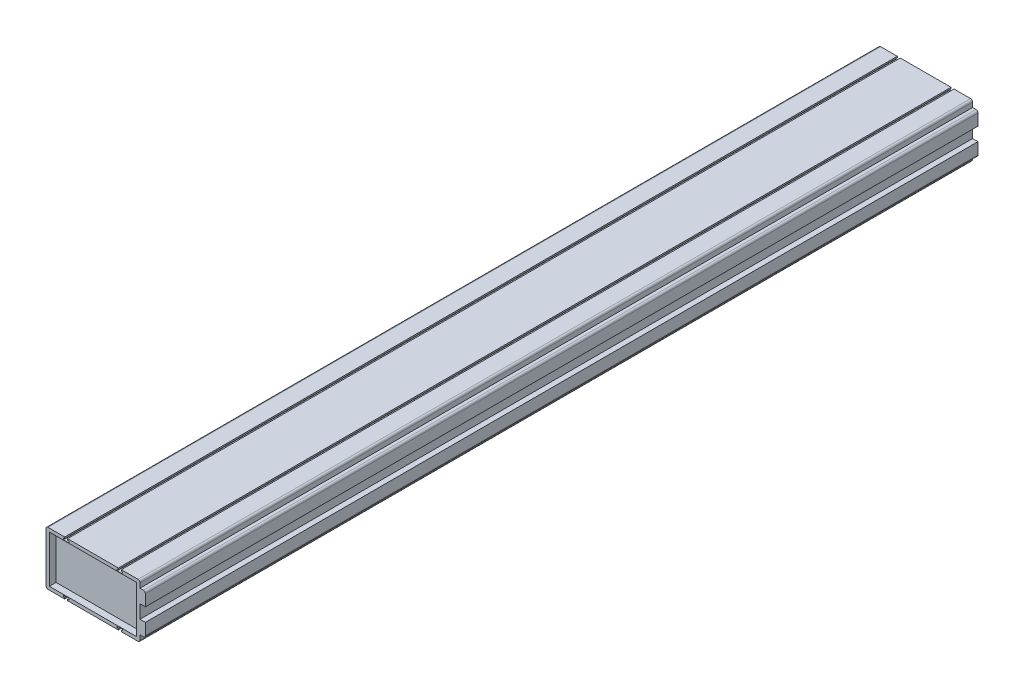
ISO-10303-21;
HEADER;
FILE_DESCRIPTION(('STEP AP214'),'2;1');
FILE_NAME('part.step','',(''),(''),'','','');
FILE_SCHEMA(('AUTOMOTIVE_DESIGN { 1 0 10303 214 1 1 1 1 }'));
ENDSEC;
DATA;
#1=APPLICATION_CONTEXT('core data for automotive mechanical design processes');
#2=APPLICATION_PROTOCOL_DEFINITION('international standard','automotive_design',2000,#1);
#3=PRODUCT_CONTEXT('',#1,'mechanical');
#4=PRODUCT('Part','Part','',(#3));
#5=PRODUCT_RELATED_PRODUCT_CATEGORY('part','',(#4));
#6=PRODUCT_DEFINITION_FORMATION('','',#4);
#7=PRODUCT_DEFINITION_CONTEXT('part definition',#1,'design');
#8=PRODUCT_DEFINITION('design','',#6,#7);
#9=PRODUCT_DEFINITION_SHAPE('','',#8);
#10=(LENGTH_UNIT() NAMED_UNIT(*) SI_UNIT(.MILLI.,.METRE.));
#11=(NAMED_UNIT(*) PLANE_ANGLE_UNIT() SI_UNIT($,.RADIAN.));
#12=(NAMED_UNIT(*) SI_UNIT($,.STERADIAN.) SOLID_ANGLE_UNIT());
#13=UNCERTAINTY_MEASURE_WITH_UNIT(LENGTH_MEASURE(1.E-05),#10,'distance_accuracy_value','');
#14=(GEOMETRIC_REPRESENTATION_CONTEXT(3) GLOBAL_UNCERTAINTY_ASSIGNED_CONTEXT((#13)) GLOBAL_UNIT_ASSIGNED_CONTEXT((#10,
#11,#12)) REPRESENTATION_CONTEXT('',''));
#15=CARTESIAN_POINT('',(0.,0.,0.));
#16=DIRECTION('',(0.,0.,1.));
#17=DIRECTION('',(1.,0.,0.));
#18=AXIS2_PLACEMENT_3D('',#15,#16,#17);
#19=CARTESIAN_POINT('',(67.,36.9999999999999,-620.000000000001));
#20=DIRECTION('',(0.,0.,1.));
#21=DIRECTION('',(1.,0.,0.));
#22=AXIS2_PLACEMENT_3D('',#19,#20,#21);
#23=PLANE('',#22);
#24=DIRECTION('',(1.,0.,0.));
#25=VECTOR('',#24,1.);
#26=CARTESIAN_POINT('',(-42.2,-38.,-620.000000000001));
#27=LINE('',#26,#25);
#28=CARTESIAN_POINT('',(-44.,-38.,-620.000000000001));
#29=VERTEX_POINT('',#28);
#30=CARTESIAN_POINT('',(-42.2,-38.,-620.000000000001));
#31=VERTEX_POINT('',#30);
#32=EDGE_CURVE('E816',#29,#31,#27,.T.);
#33=ORIENTED_EDGE('',*,*,#32,.T.);
#34=DIRECTION('',(0.,-1.,0.));
#35=VECTOR('',#34,1.);
#36=CARTESIAN_POINT('',(-42.2,-40.,-620.000000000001));
#37=LINE('',#36,#35);
#38=CARTESIAN_POINT('',(-42.2,-40.,-620.000000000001));
#39=VERTEX_POINT('',#38);
#40=EDGE_CURVE('E819',#31,#39,#37,.T.);
#41=ORIENTED_EDGE('',*,*,#40,.T.);
#42=DIRECTION('',(1.,0.,0.));
#43=VECTOR('',#42,1.);
#44=CARTESIAN_POINT('',(-67.,-40.,-620.000000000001));
#45=LINE('',#44,#43);
#46=CARTESIAN_POINT('',(-67.,-40.,-620.000000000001));
#47=VERTEX_POINT('',#46);
#48=EDGE_CURVE('E1017',#47,#39,#45,.T.);
#49=ORIENTED_EDGE('',*,*,#48,.F.);
#50=CARTESIAN_POINT('',(-67.,-36.9999999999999,-620.000000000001));
#51=DIRECTION('',(0.,0.,1.));
#52=DIRECTION('',(-1.,0.,0.));
#53=AXIS2_PLACEMENT_3D('',#50,#51,#52);
#54=CIRCLE('',#53,3.00000000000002);
#55=CARTESIAN_POINT('',(-70.,-36.9999999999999,-620.000000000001));
#56=VERTEX_POINT('',#55);
#57=EDGE_CURVE('E1014',#56,#47,#54,.T.);
#58=ORIENTED_EDGE('',*,*,#57,.F.);
#59=DIRECTION('',(0.,-1.,0.));
#60=VECTOR('',#59,1.);
#61=CARTESIAN_POINT('',(-70.,36.9999999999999,-620.000000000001));
#62=LINE('',#61,#60);
#63=CARTESIAN_POINT('',(-70.,36.9999999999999,-620.000000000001));
#64=VERTEX_POINT('',#63);
#65=EDGE_CURVE('E1012',#64,#56,#62,.T.);
#66=ORIENTED_EDGE('',*,*,#65,.F.);
#67=CARTESIAN_POINT('',(-67.,36.9999999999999,-620.000000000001));
#68=DIRECTION('',(0.,0.,1.));
#69=DIRECTION('',(-1.,0.,0.));
#70=AXIS2_PLACEMENT_3D('',#67,#68,#69);
#71=CIRCLE('',#70,3.00000000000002);
#72=CARTESIAN_POINT('',(-67.,40.,-620.000000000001));
#73=VERTEX_POINT('',#72);
#74=EDGE_CURVE('E1009',#73,#64,#71,.T.);
#75=ORIENTED_EDGE('',*,*,#74,.F.);
#76=DIRECTION('',(-1.,0.,0.));
#77=VECTOR('',#76,1.);
#78=CARTESIAN_POINT('',(-67.,40.,-620.000000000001));
#79=LINE('',#78,#77);
#80=CARTESIAN_POINT('',(-42.2,40.,-620.000000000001));
#81=VERTEX_POINT('',#80);
#82=EDGE_CURVE('E1005',#81,#73,#79,.T.);
#83=ORIENTED_EDGE('',*,*,#82,.F.);
#84=DIRECTION('',(0.,1.,0.));
#85=VECTOR('',#84,1.);
#86=CARTESIAN_POINT('',(-42.2,40.,-620.000000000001));
#87=LINE('',#86,#85);
#88=CARTESIAN_POINT('',(-42.2,38.,-620.000000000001));
#89=VERTEX_POINT('',#88);
#90=EDGE_CURVE('E912',#89,#81,#87,.T.);
#91=ORIENTED_EDGE('',*,*,#90,.F.);
#92=DIRECTION('',(1.,0.,0.));
#93=VECTOR('',#92,1.);
#94=CARTESIAN_POINT('',(-42.2,38.,-620.000000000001));
#95=LINE('',#94,#93);
#96=CARTESIAN_POINT('',(-44.,38.,-620.000000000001));
#97=VERTEX_POINT('',#96);
#98=EDGE_CURVE('E914',#97,#89,#95,.T.);
#99=ORIENTED_EDGE('',*,*,#98,.F.);
#100=DIRECTION('',(0.,1.,0.));
#101=VECTOR('',#100,1.);
#102=CARTESIAN_POINT('',(-44.,38.,-620.000000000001));
#103=LINE('',#102,#101);
#104=CARTESIAN_POINT('',(-44.,35.5000000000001,-620.000000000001));
#105=VERTEX_POINT('',#104);
#106=EDGE_CURVE('E917',#105,#97,#103,.T.);
#107=ORIENTED_EDGE('',*,*,#106,.F.);
#108=DIRECTION('',(-1.,0.,0.));
#109=VECTOR('',#108,1.);
#110=CARTESIAN_POINT('',(-44.,35.5000000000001,-620.000000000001));
#111=LINE('',#110,#109);
#112=CARTESIAN_POINT('',(-36.,35.5000000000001,-620.000000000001));
#113=VERTEX_POINT('',#112);
#114=EDGE_CURVE('E919',#113,#105,#111,.T.);
#115=ORIENTED_EDGE('',*,*,#114,.F.);
#116=DIRECTION('',(0.,-1.,0.));
#117=VECTOR('',#116,1.);
#118=CARTESIAN_POINT('',(-36.,38.,-620.000000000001));
#119=LINE('',#118,#117);
#120=CARTESIAN_POINT('',(-36.,38.,-620.000000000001));
#121=VERTEX_POINT('',#120);
#122=EDGE_CURVE('E921',#121,#113,#119,.T.);
#123=ORIENTED_EDGE('',*,*,#122,.F.);
#124=DIRECTION('',(1.,0.,0.));
#125=VECTOR('',#124,1.);
#126=CARTESIAN_POINT('',(-37.8,38.,-620.000000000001));
#127=LINE('',#126,#125);
#128=CARTESIAN_POINT('',(-37.8,38.,-620.000000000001));
#129=VERTEX_POINT('',#128);
#130=EDGE_CURVE('E923',#129,#121,#127,.T.);
#131=ORIENTED_EDGE('',*,*,#130,.F.);
#132=DIRECTION('',(0.,-1.,0.));
#133=VECTOR('',#132,1.);
#134=CARTESIAN_POINT('',(-37.8,40.,-620.000000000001));
#135=LINE('',#134,#133);
#136=CARTESIAN_POINT('',(-37.8,40.,-620.000000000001));
#137=VERTEX_POINT('',#136);
#138=EDGE_CURVE('E925',#137,#129,#135,.T.);
#139=ORIENTED_EDGE('',*,*,#138,.F.);
#140=CARTESIAN_POINT('',(37.8,40.,-620.000000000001));
#141=VERTEX_POINT('',#140);
#142=EDGE_CURVE('E1010',#141,#137,#79,.T.);
#143=ORIENTED_EDGE('',*,*,#142,.F.);
#144=DIRECTION('',(0.,-1.,0.));
#145=VECTOR('',#144,1.);
#146=CARTESIAN_POINT('',(37.8,40.,-620.000000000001));
#147=LINE('',#146,#145);
#148=CARTESIAN_POINT('',(37.8,38.,-620.000000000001));
#149=VERTEX_POINT('',#148);
#150=EDGE_CURVE('E964',#141,#149,#147,.T.);
#151=ORIENTED_EDGE('',*,*,#150,.T.);
#152=DIRECTION('',(-1.,0.,0.));
#153=VECTOR('',#152,1.);
#154=CARTESIAN_POINT('',(37.8,38.,-620.000000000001));
#155=LINE('',#154,#153);
#156=CARTESIAN_POINT('',(36.,38.,-620.000000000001));
#157=VERTEX_POINT('',#156);
#158=EDGE_CURVE('E967',#149,#157,#155,.T.);
#159=ORIENTED_EDGE('',*,*,#158,.T.);
#160=DIRECTION('',(0.,-1.,0.));
#161=VECTOR('',#160,1.);
#162=CARTESIAN_POINT('',(36.,38.,-620.000000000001));
#163=LINE('',#162,#161);
#164=CARTESIAN_POINT('',(36.,35.5000000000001,-620.000000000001));
#165=VERTEX_POINT('',#164);
#166=EDGE_CURVE('E970',#157,#165,#163,.T.);
#167=ORIENTED_EDGE('',*,*,#166,.T.);
#168=DIRECTION('',(1.,0.,0.));
#169=VECTOR('',#168,1.);
#170=CARTESIAN_POINT('',(44.,35.5000000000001,-620.000000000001));
#171=LINE('',#170,#169);
#172=CARTESIAN_POINT('',(44.,35.5000000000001,-620.000000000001));
#173=VERTEX_POINT('',#172);
#174=EDGE_CURVE('E973',#165,#173,#171,.T.);
#175=ORIENTED_EDGE('',*,*,#174,.T.);
#176=DIRECTION('',(0.,1.,0.));
#177=VECTOR('',#176,1.);
#178=CARTESIAN_POINT('',(44.,38.,-620.000000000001));
#179=LINE('',#178,#177);
#180=CARTESIAN_POINT('',(44.,38.,-620.000000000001));
#181=VERTEX_POINT('',#180);
#182=EDGE_CURVE('E976',#173,#181,#179,.T.);
#183=ORIENTED_EDGE('',*,*,#182,.T.);
#184=DIRECTION('',(-1.,0.,0.));
#185=VECTOR('',#184,1.);
#186=CARTESIAN_POINT('',(42.2,38.,-620.000000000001));
#187=LINE('',#186,#185);
#188=CARTESIAN_POINT('',(42.2,38.,-620.000000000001));
#189=VERTEX_POINT('',#188);
#190=EDGE_CURVE('E979',#181,#189,#187,.T.);
#191=ORIENTED_EDGE('',*,*,#190,.T.);
#192=DIRECTION('',(0.,1.,0.));
#193=VECTOR('',#192,1.);
#194=CARTESIAN_POINT('',(42.2,40.,-620.000000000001));
#195=LINE('',#194,#193);
#196=CARTESIAN_POINT('',(42.2,40.,-620.000000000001));
#197=VERTEX_POINT('',#196);
#198=EDGE_CURVE('E982',#189,#197,#195,.T.);
#199=ORIENTED_EDGE('',*,*,#198,.T.);
#200=CARTESIAN_POINT('',(67.,40.,-620.000000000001));
#201=VERTEX_POINT('',#200);
#202=EDGE_CURVE('E1006',#201,#197,#79,.T.);
#203=ORIENTED_EDGE('',*,*,#202,.F.);
#204=CARTESIAN_POINT('',(67.,36.9999999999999,-620.000000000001));
#205=DIRECTION('',(0.,0.,1.));
#206=DIRECTION('',(1.,0.,0.));
#207=AXIS2_PLACEMENT_3D('',#204,#205,#206);
#208=CIRCLE('',#207,3.00000000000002);
#209=CARTESIAN_POINT('',(70.,36.9999999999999,-620.000000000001));
#210=VERTEX_POINT('',#209);
#211=EDGE_CURVE('E989',#210,#201,#208,.T.);
#212=ORIENTED_EDGE('',*,*,#211,.F.);
#213=DIRECTION('',(0.,1.,0.));
#214=VECTOR('',#213,1.);
#215=CARTESIAN_POINT('',(70.,36.9999999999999,-620.000000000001));
#216=LINE('',#215,#214);
#217=CARTESIAN_POINT('',(70.,30.,-620.000000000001));
#218=VERTEX_POINT('',#217);
#219=EDGE_CURVE('E1043',#218,#210,#216,.T.);
#220=ORIENTED_EDGE('',*,*,#219,.F.);
#221=DIRECTION('',(-1.,0.,0.));
#222=VECTOR('',#221,1.);
#223=CARTESIAN_POINT('',(70.,30.,-620.000000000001));
#224=LINE('',#223,#222);
#225=CARTESIAN_POINT('',(75.,30.,-620.000000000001));
#226=VERTEX_POINT('',#225);
#227=EDGE_CURVE('E1041',#226,#218,#224,.T.);
#228=ORIENTED_EDGE('',*,*,#227,.F.);
#229=CARTESIAN_POINT('',(75.,26.9999999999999,-620.000000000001));
#230=DIRECTION('',(0.,0.,1.));
#231=DIRECTION('',(1.,0.,0.));
#232=AXIS2_PLACEMENT_3D('',#229,#230,#231);
#233=CIRCLE('',#232,2.99999999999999);
#234=CARTESIAN_POINT('',(78.,26.9999999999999,-620.000000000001));
#235=VERTEX_POINT('',#234);
#236=EDGE_CURVE('E1039',#235,#226,#233,.T.);
#237=ORIENTED_EDGE('',*,*,#236,.F.);
#238=DIRECTION('',(0.,1.,0.));
#239=VECTOR('',#238,1.);
#240=CARTESIAN_POINT('',(78.,26.9999999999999,-620.000000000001));
#241=LINE('',#240,#239);
#242=CARTESIAN_POINT('',(78.,10.,-620.000000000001));
#243=VERTEX_POINT('',#242);
#244=EDGE_CURVE('E1037',#243,#235,#241,.T.);
#245=ORIENTED_EDGE('',*,*,#244,.F.);
#246=DIRECTION('',(1.,0.,0.));
#247=VECTOR('',#246,1.);
#248=CARTESIAN_POINT('',(78.,10.,-620.000000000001));
#249=LINE('',#248,#247);
#250=CARTESIAN_POINT('',(70.,10.,-620.000000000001));
#251=VERTEX_POINT('',#250);
#252=EDGE_CURVE('E1035',#251,#243,#249,.T.);
#253=ORIENTED_EDGE('',*,*,#252,.F.);
#254=DIRECTION('',(0.,1.,0.));
#255=VECTOR('',#254,1.);
#256=CARTESIAN_POINT('',(70.,10.,-620.000000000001));
#257=LINE('',#256,#255);
#258=CARTESIAN_POINT('',(70.,-10.,-620.000000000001));
#259=VERTEX_POINT('',#258);
#260=EDGE_CURVE('E1033',#259,#251,#257,.T.);
#261=ORIENTED_EDGE('',*,*,#260,.F.);
#262=DIRECTION('',(-1.,0.,0.));
#263=VECTOR('',#262,1.);
#264=CARTESIAN_POINT('',(78.,-10.,-620.000000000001));
#265=LINE('',#264,#263);
#266=CARTESIAN_POINT('',(78.,-10.,-620.000000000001));
#267=VERTEX_POINT('',#266);
#268=EDGE_CURVE('E1031',#267,#259,#265,.T.);
#269=ORIENTED_EDGE('',*,*,#268,.F.);
#270=DIRECTION('',(0.,1.,0.));
#271=VECTOR('',#270,1.);
#272=CARTESIAN_POINT('',(78.,-10.,-620.000000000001));
#273=LINE('',#272,#271);
#274=CARTESIAN_POINT('',(78.,-26.9999999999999,-620.000000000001));
#275=VERTEX_POINT('',#274);
#276=EDGE_CURVE('E1029',#275,#267,#273,.T.);
#277=ORIENTED_EDGE('',*,*,#276,.F.);
#278=CARTESIAN_POINT('',(75.,-26.9999999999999,-620.000000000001));
#279=DIRECTION('',(0.,0.,1.));
#280=DIRECTION('',(-1.,0.,0.));
#281=AXIS2_PLACEMENT_3D('',#278,#279,#280);
#282=CIRCLE('',#281,2.99999999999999);
#283=CARTESIAN_POINT('',(75.,-30.,-620.000000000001));
#284=VERTEX_POINT('',#283);
#285=EDGE_CURVE('E1027',#284,#275,#282,.T.);
#286=ORIENTED_EDGE('',*,*,#285,.F.);
#287=DIRECTION('',(1.,0.,0.));
#288=VECTOR('',#287,1.);
#289=CARTESIAN_POINT('',(70.,-30.,-620.000000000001));
#290=LINE('',#289,#288);
#291=CARTESIAN_POINT('',(70.,-30.,-620.000000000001));
#292=VERTEX_POINT('',#291);
#293=EDGE_CURVE('E1025',#292,#284,#290,.T.);
#294=ORIENTED_EDGE('',*,*,#293,.F.);
#295=DIRECTION('',(0.,1.,0.));
#296=VECTOR('',#295,1.);
#297=CARTESIAN_POINT('',(70.,-30.,-620.000000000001));
#298=LINE('',#297,#296);
#299=CARTESIAN_POINT('',(70.,-36.9999999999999,-620.000000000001));
#300=VERTEX_POINT('',#299);
#301=EDGE_CURVE('E1023',#300,#292,#298,.T.);
#302=ORIENTED_EDGE('',*,*,#301,.F.);
#303=CARTESIAN_POINT('',(67.,-36.9999999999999,-620.000000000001));
#304=DIRECTION('',(0.,0.,1.));
#305=DIRECTION('',(-1.,0.,0.));
#306=AXIS2_PLACEMENT_3D('',#303,#304,#305);
#307=CIRCLE('',#306,3.00000000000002);
#308=CARTESIAN_POINT('',(67.,-40.,-620.000000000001));
#309=VERTEX_POINT('',#308);
#310=EDGE_CURVE('E1020',#309,#300,#307,.T.);
#311=ORIENTED_EDGE('',*,*,#310,.F.);
#312=CARTESIAN_POINT('',(42.2,-40.,-620.000000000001));
#313=VERTEX_POINT('',#312);
#314=EDGE_CURVE('E1016',#313,#309,#45,.T.);
#315=ORIENTED_EDGE('',*,*,#314,.F.);
#316=DIRECTION('',(0.,-1.,0.));
#317=VECTOR('',#316,1.);
#318=CARTESIAN_POINT('',(42.2,-40.,-620.000000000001));
#319=LINE('',#318,#317);
#320=CARTESIAN_POINT('',(42.2,-38.,-620.000000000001));
#321=VERTEX_POINT('',#320);
#322=EDGE_CURVE('E860',#321,#313,#319,.T.);
#323=ORIENTED_EDGE('',*,*,#322,.F.);
#324=DIRECTION('',(-1.,0.,0.));
#325=VECTOR('',#324,1.);
#326=CARTESIAN_POINT('',(42.2,-38.,-620.000000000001));
#327=LINE('',#326,#325);
#328=CARTESIAN_POINT('',(44.,-38.,-620.000000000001));
#329=VERTEX_POINT('',#328);
#330=EDGE_CURVE('E862',#329,#321,#327,.T.);
#331=ORIENTED_EDGE('',*,*,#330,.F.);
#332=DIRECTION('',(0.,-1.,0.));
#333=VECTOR('',#332,1.);
#334=CARTESIAN_POINT('',(44.,-38.,-620.000000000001));
#335=LINE('',#334,#333);
#336=CARTESIAN_POINT('',(44.,-35.5000000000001,-620.000000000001));
#337=VERTEX_POINT('',#336);
#338=EDGE_CURVE('E864',#337,#329,#335,.T.);
#339=ORIENTED_EDGE('',*,*,#338,.F.);
#340=DIRECTION('',(1.,0.,0.));
#341=VECTOR('',#340,1.);
#342=CARTESIAN_POINT('',(44.,-35.5000000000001,-620.000000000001));
#343=LINE('',#342,#341);
#344=CARTESIAN_POINT('',(36.,-35.5000000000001,-620.000000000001));
#345=VERTEX_POINT('',#344);
#346=EDGE_CURVE('E866',#345,#337,#343,.T.);
#347=ORIENTED_EDGE('',*,*,#346,.F.);
#348=DIRECTION('',(0.,1.,0.));
#349=VECTOR('',#348,1.);
#350=CARTESIAN_POINT('',(36.,-38.,-620.000000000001));
#351=LINE('',#350,#349);
#352=CARTESIAN_POINT('',(36.,-38.,-620.000000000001));
#353=VERTEX_POINT('',#352);
#354=EDGE_CURVE('E868',#353,#345,#351,.T.);
#355=ORIENTED_EDGE('',*,*,#354,.F.);
#356=DIRECTION('',(-1.,0.,0.));
#357=VECTOR('',#356,1.);
#358=CARTESIAN_POINT('',(37.8,-38.,-620.000000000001));
#359=LINE('',#358,#357);
#360=CARTESIAN_POINT('',(37.8,-38.,-620.000000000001));
#361=VERTEX_POINT('',#360);
#362=EDGE_CURVE('E870',#361,#353,#359,.T.);
#363=ORIENTED_EDGE('',*,*,#362,.F.);
#364=DIRECTION('',(0.,1.,0.));
#365=VECTOR('',#364,1.);
#366=CARTESIAN_POINT('',(37.8,-40.,-620.000000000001));
#367=LINE('',#366,#365);
#368=CARTESIAN_POINT('',(37.8,-40.,-620.000000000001));
#369=VERTEX_POINT('',#368);
#370=EDGE_CURVE('E872',#369,#361,#367,.T.);
#371=ORIENTED_EDGE('',*,*,#370,.F.);
#372=CARTESIAN_POINT('',(-37.8,-40.,-620.000000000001));
#373=VERTEX_POINT('',#372);
#374=EDGE_CURVE('E1021',#373,#369,#45,.T.);
#375=ORIENTED_EDGE('',*,*,#374,.F.);
#376=DIRECTION('',(0.,1.,0.));
#377=VECTOR('',#376,1.);
#378=CARTESIAN_POINT('',(-37.8,-40.,-620.000000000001));
#379=LINE('',#378,#377);
#380=CARTESIAN_POINT('',(-37.8,-38.,-620.000000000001));
#381=VERTEX_POINT('',#380);
#382=EDGE_CURVE('E801',#373,#381,#379,.T.);
#383=ORIENTED_EDGE('',*,*,#382,.T.);
#384=DIRECTION('',(1.,0.,0.));
#385=VECTOR('',#384,1.);
#386=CARTESIAN_POINT('',(-37.8,-38.,-620.000000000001));
#387=LINE('',#386,#385);
#388=CARTESIAN_POINT('',(-36.,-38.,-620.000000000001));
#389=VERTEX_POINT('',#388);
#390=EDGE_CURVE('E804',#381,#389,#387,.T.);
#391=ORIENTED_EDGE('',*,*,#390,.T.);
#392=DIRECTION('',(0.,1.,0.));
#393=VECTOR('',#392,1.);
#394=CARTESIAN_POINT('',(-36.,-38.,-620.000000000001));
#395=LINE('',#394,#393);
#396=CARTESIAN_POINT('',(-36.,-35.5000000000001,-620.000000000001));
#397=VERTEX_POINT('',#396);
#398=EDGE_CURVE('E807',#389,#397,#395,.T.);
#399=ORIENTED_EDGE('',*,*,#398,.T.);
#400=DIRECTION('',(-1.,0.,0.));
#401=VECTOR('',#400,1.);
#402=CARTESIAN_POINT('',(-44.,-35.5000000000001,-620.000000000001));
#403=LINE('',#402,#401);
#404=CARTESIAN_POINT('',(-44.,-35.5000000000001,-620.000000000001));
#405=VERTEX_POINT('',#404);
#406=EDGE_CURVE('E810',#397,#405,#403,.T.);
#407=ORIENTED_EDGE('',*,*,#406,.T.);
#408=DIRECTION('',(0.,-1.,0.));
#409=VECTOR('',#408,1.);
#410=CARTESIAN_POINT('',(-44.,-38.,-620.000000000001));
#411=LINE('',#410,#409);
#412=EDGE_CURVE('E813',#405,#29,#411,.T.);
#413=ORIENTED_EDGE('',*,*,#412,.T.);
#414=EDGE_LOOP('',(#33,#41,#49,#58,#66,#75,#83,#91,#99,#107,#115,#123,#131,#139,#143,#151,#159,
#167,#175,#183,#191,#199,#203,#212,#220,#228,#237,#245,#253,#261,#269,#277,#286,#294,#302,#311,
#315,#323,#331,#339,#347,#355,#363,#371,#375,#383,#391,#399,#407,#413));
#415=FACE_BOUND('',#414,.T.);
#416=DIRECTION('',(0.,-1.,0.));
#417=VECTOR('',#416,1.);
#418=CARTESIAN_POINT('',(-65.,34.9999999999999,-620.000000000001));
#419=LINE('',#418,#417);
#420=CARTESIAN_POINT('',(-65.,34.9999999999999,-620.000000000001));
#421=VERTEX_POINT('',#420);
#422=CARTESIAN_POINT('',(-65.,-34.9999999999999,-620.000000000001));
#423=VERTEX_POINT('',#422);
#424=EDGE_CURVE('E363',#421,#423,#419,.T.);
#425=ORIENTED_EDGE('',*,*,#424,.T.);
#426=DIRECTION('',(1.,0.,0.));
#427=VECTOR('',#426,1.);
#428=CARTESIAN_POINT('',(-65.,-34.9999999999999,-620.000000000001));
#429=LINE('',#428,#427);
#430=CARTESIAN_POINT('',(65.,-34.9999999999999,-620.000000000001));
#431=VERTEX_POINT('',#430);
#432=EDGE_CURVE('E734',#423,#431,#429,.T.);
#433=ORIENTED_EDGE('',*,*,#432,.T.);
#434=DIRECTION('',(0.,1.,0.));
#435=VECTOR('',#434,1.);
#436=CARTESIAN_POINT('',(65.,34.9999999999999,-620.000000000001));
#437=LINE('',#436,#435);
#438=CARTESIAN_POINT('',(65.,34.9999999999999,-620.000000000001));
#439=VERTEX_POINT('',#438);
#440=EDGE_CURVE('E720',#431,#439,#437,.T.);
#441=ORIENTED_EDGE('',*,*,#440,.T.);
#442=DIRECTION('',(-1.,0.,0.));
#443=VECTOR('',#442,1.);
#444=CARTESIAN_POINT('',(-65.,34.9999999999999,-620.000000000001));
#445=LINE('',#444,#443);
#446=EDGE_CURVE('E730',#439,#421,#445,.T.);
#447=ORIENTED_EDGE('',*,*,#446,.T.);
#448=EDGE_LOOP('',(#425,#433,#441,#447));
#449=FACE_BOUND('',#448,.T.);
#450=ADVANCED_FACE('F348',(#415,#449),#23,.F.);
#451=CARTESIAN_POINT('',(-67.,-40.,620.));
#452=DIRECTION('',(0.,1.,0.));
#453=DIRECTION('',(-1.,0.,0.));
#454=AXIS2_PLACEMENT_3D('',#451,#452,#453);
#455=PLANE('',#454);
#456=ORIENTED_EDGE('',*,*,#48,.T.);
#457=DIRECTION('',(0.,0.,1.));
#458=VECTOR('',#457,1.);
#459=CARTESIAN_POINT('',(-42.2,-40.,-620.000000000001));
#460=LINE('',#459,#458);
#461=CARTESIAN_POINT('',(-42.2,-40.,620.));
#462=VERTEX_POINT('',#461);
#463=EDGE_CURVE('E823',#39,#462,#460,.T.);
#464=ORIENTED_EDGE('',*,*,#463,.T.);
#465=DIRECTION('',(1.,0.,0.));
#466=VECTOR('',#465,1.);
#467=CARTESIAN_POINT('',(-67.,-40.,620.));
#468=LINE('',#467,#466);
#469=CARTESIAN_POINT('',(-67.,-40.,620.));
#470=VERTEX_POINT('',#469);
#471=EDGE_CURVE('E1060',#470,#462,#468,.T.);
#472=ORIENTED_EDGE('',*,*,#471,.F.);
#473=DIRECTION('',(0.,0.,-1.));
#474=VECTOR('',#473,1.);
#475=CARTESIAN_POINT('',(-67.,-40.,620.));
#476=LINE('',#475,#474);
#477=EDGE_CURVE('E1127',#470,#47,#476,.T.);
#478=ORIENTED_EDGE('',*,*,#477,.T.);
#479=EDGE_LOOP('',(#456,#464,#472,#478));
#480=FACE_BOUND('',#479,.T.);
#481=ADVANCED_FACE('F1215',(#480),#455,.F.);
#482=CARTESIAN_POINT('',(67.,36.9999999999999,620.));
#483=DIRECTION('',(0.,0.,1.));
#484=DIRECTION('',(1.,0.,0.));
#485=AXIS2_PLACEMENT_3D('',#482,#483,#484);
#486=PLANE('',#485);
#487=DIRECTION('',(0.,-1.,0.));
#488=VECTOR('',#487,1.);
#489=CARTESIAN_POINT('',(-65.,34.9999999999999,620.));
#490=LINE('',#489,#488);
#491=CARTESIAN_POINT('',(-65.,34.9999999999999,620.));
#492=VERTEX_POINT('',#491);
#493=CARTESIAN_POINT('',(-65.,-34.9999999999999,620.));
#494=VERTEX_POINT('',#493);
#495=EDGE_CURVE('E371',#492,#494,#490,.T.);
#496=ORIENTED_EDGE('',*,*,#495,.F.);
#497=DIRECTION('',(-1.,0.,0.));
#498=VECTOR('',#497,1.);
#499=CARTESIAN_POINT('',(-65.,34.9999999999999,620.));
#500=LINE('',#499,#498);
#501=CARTESIAN_POINT('',(65.,34.9999999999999,620.));
#502=VERTEX_POINT('',#501);
#503=EDGE_CURVE('E758',#502,#492,#500,.T.);
#504=ORIENTED_EDGE('',*,*,#503,.F.);
#505=DIRECTION('',(0.,1.,0.));
#506=VECTOR('',#505,1.);
#507=CARTESIAN_POINT('',(65.,34.9999999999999,620.));
#508=LINE('',#507,#506);
#509=CARTESIAN_POINT('',(65.,-34.9999999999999,620.));
#510=VERTEX_POINT('',#509);
#511=EDGE_CURVE('E755',#510,#502,#508,.T.);
#512=ORIENTED_EDGE('',*,*,#511,.F.);
#513=DIRECTION('',(1.,0.,0.));
#514=VECTOR('',#513,1.);
#515=CARTESIAN_POINT('',(-65.,-34.9999999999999,620.));
#516=LINE('',#515,#514);
#517=EDGE_CURVE('E752',#494,#510,#516,.T.);
#518=ORIENTED_EDGE('',*,*,#517,.F.);
#519=EDGE_LOOP('',(#496,#504,#512,#518));
#520=FACE_BOUND('',#519,.T.);
#521=DIRECTION('',(0.,-1.,0.));
#522=VECTOR('',#521,1.);
#523=CARTESIAN_POINT('',(-42.2,-40.,620.));
#524=LINE('',#523,#522);
#525=CARTESIAN_POINT('',(-42.2,-38.,620.));
#526=VERTEX_POINT('',#525);
#527=EDGE_CURVE('E799',#526,#462,#524,.T.);
#528=ORIENTED_EDGE('',*,*,#527,.F.);
#529=DIRECTION('',(1.,0.,0.));
#530=VECTOR('',#529,1.);
#531=CARTESIAN_POINT('',(-42.2,-38.,620.));
#532=LINE('',#531,#530);
#533=CARTESIAN_POINT('',(-44.,-38.,620.));
#534=VERTEX_POINT('',#533);
#535=EDGE_CURVE('E796',#534,#526,#532,.T.);
#536=ORIENTED_EDGE('',*,*,#535,.F.);
#537=DIRECTION('',(0.,-1.,0.));
#538=VECTOR('',#537,1.);
#539=CARTESIAN_POINT('',(-44.,-38.,620.));
#540=LINE('',#539,#538);
#541=CARTESIAN_POINT('',(-44.,-35.5000000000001,620.));
#542=VERTEX_POINT('',#541);
#543=EDGE_CURVE('E793',#542,#534,#540,.T.);
#544=ORIENTED_EDGE('',*,*,#543,.F.);
#545=DIRECTION('',(-1.,0.,0.));
#546=VECTOR('',#545,1.);
#547=CARTESIAN_POINT('',(-44.,-35.5000000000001,620.));
#548=LINE('',#547,#546);
#549=CARTESIAN_POINT('',(-36.,-35.5000000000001,620.));
#550=VERTEX_POINT('',#549);
#551=EDGE_CURVE('E790',#550,#542,#548,.T.);
#552=ORIENTED_EDGE('',*,*,#551,.F.);
#553=DIRECTION('',(0.,1.,0.));
#554=VECTOR('',#553,1.);
#555=CARTESIAN_POINT('',(-36.,-38.,620.));
#556=LINE('',#555,#554);
#557=CARTESIAN_POINT('',(-36.,-38.,620.));
#558=VERTEX_POINT('',#557);
#559=EDGE_CURVE('E787',#558,#550,#556,.T.);
#560=ORIENTED_EDGE('',*,*,#559,.F.);
#561=DIRECTION('',(1.,0.,0.));
#562=VECTOR('',#561,1.);
#563=CARTESIAN_POINT('',(-37.8,-38.,620.));
#564=LINE('',#563,#562);
#565=CARTESIAN_POINT('',(-37.8,-38.,620.));
#566=VERTEX_POINT('',#565);
#567=EDGE_CURVE('E784',#566,#558,#564,.T.);
#568=ORIENTED_EDGE('',*,*,#567,.F.);
#569=DIRECTION('',(0.,1.,0.));
#570=VECTOR('',#569,1.);
#571=CARTESIAN_POINT('',(-37.8,-40.,620.));
#572=LINE('',#571,#570);
#573=CARTESIAN_POINT('',(-37.8,-40.,620.));
#574=VERTEX_POINT('',#573);
#575=EDGE_CURVE('E776',#574,#566,#572,.T.);
#576=ORIENTED_EDGE('',*,*,#575,.F.);
#577=CARTESIAN_POINT('',(37.8,-40.,620.));
#578=VERTEX_POINT('',#577);
#579=EDGE_CURVE('E1064',#574,#578,#468,.T.);
#580=ORIENTED_EDGE('',*,*,#579,.T.);
#581=DIRECTION('',(0.,1.,0.));
#582=VECTOR('',#581,1.);
#583=CARTESIAN_POINT('',(37.8,-40.,620.));
#584=LINE('',#583,#582);
#585=CARTESIAN_POINT('',(37.8,-38.,620.));
#586=VERTEX_POINT('',#585);
#587=EDGE_CURVE('E857',#578,#586,#584,.T.);
#588=ORIENTED_EDGE('',*,*,#587,.T.);
#589=DIRECTION('',(-1.,0.,0.));
#590=VECTOR('',#589,1.);
#591=CARTESIAN_POINT('',(37.8,-38.,620.));
#592=LINE('',#591,#590);
#593=CARTESIAN_POINT('',(36.,-38.,620.));
#594=VERTEX_POINT('',#593);
#595=EDGE_CURVE('E854',#586,#594,#592,.T.);
#596=ORIENTED_EDGE('',*,*,#595,.T.);
#597=DIRECTION('',(0.,1.,0.));
#598=VECTOR('',#597,1.);
#599=CARTESIAN_POINT('',(36.,-38.,620.));
#600=LINE('',#599,#598);
#601=CARTESIAN_POINT('',(36.,-35.5000000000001,620.));
#602=VERTEX_POINT('',#601);
#603=EDGE_CURVE('E851',#594,#602,#600,.T.);
#604=ORIENTED_EDGE('',*,*,#603,.T.);
#605=DIRECTION('',(1.,0.,0.));
#606=VECTOR('',#605,1.);
#607=CARTESIAN_POINT('',(44.,-35.5000000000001,620.));
#608=LINE('',#607,#606);
#609=CARTESIAN_POINT('',(44.,-35.5000000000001,620.));
#610=VERTEX_POINT('',#609);
#611=EDGE_CURVE('E848',#602,#610,#608,.T.);
#612=ORIENTED_EDGE('',*,*,#611,.T.);
#613=DIRECTION('',(0.,-1.,0.));
#614=VECTOR('',#613,1.);
#615=CARTESIAN_POINT('',(44.,-38.,620.));
#616=LINE('',#615,#614);
#617=CARTESIAN_POINT('',(44.,-38.,620.));
#618=VERTEX_POINT('',#617);
#619=EDGE_CURVE('E845',#610,#618,#616,.T.);
#620=ORIENTED_EDGE('',*,*,#619,.T.);
#621=DIRECTION('',(-1.,0.,0.));
#622=VECTOR('',#621,1.);
#623=CARTESIAN_POINT('',(42.2,-38.,620.));
#624=LINE('',#623,#622);
#625=CARTESIAN_POINT('',(42.2,-38.,620.));
#626=VERTEX_POINT('',#625);
#627=EDGE_CURVE('E842',#618,#626,#624,.T.);
#628=ORIENTED_EDGE('',*,*,#627,.T.);
#629=DIRECTION('',(0.,-1.,0.));
#630=VECTOR('',#629,1.);
#631=CARTESIAN_POINT('',(42.2,-40.,620.));
#632=LINE('',#631,#630);
#633=CARTESIAN_POINT('',(42.2,-40.,620.));
#634=VERTEX_POINT('',#633);
#635=EDGE_CURVE('E826',#626,#634,#632,.T.);
#636=ORIENTED_EDGE('',*,*,#635,.T.);
#637=CARTESIAN_POINT('',(67.,-40.,620.));
#638=VERTEX_POINT('',#637);
#639=EDGE_CURVE('E1059',#634,#638,#468,.T.);
#640=ORIENTED_EDGE('',*,*,#639,.T.);
#641=CARTESIAN_POINT('',(67.,-36.9999999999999,620.));
#642=DIRECTION('',(0.,0.,1.));
#643=DIRECTION('',(-1.,0.,0.));
#644=AXIS2_PLACEMENT_3D('',#641,#642,#643);
#645=CIRCLE('',#644,3.00000000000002);
#646=CARTESIAN_POINT('',(70.,-36.9999999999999,620.));
#647=VERTEX_POINT('',#646);
#648=EDGE_CURVE('E1063',#638,#647,#645,.T.);
#649=ORIENTED_EDGE('',*,*,#648,.T.);
#650=DIRECTION('',(0.,1.,0.));
#651=VECTOR('',#650,1.);
#652=CARTESIAN_POINT('',(70.,-30.,620.));
#653=LINE('',#652,#651);
#654=CARTESIAN_POINT('',(70.,-30.,620.));
#655=VERTEX_POINT('',#654);
#656=EDGE_CURVE('E1066',#647,#655,#653,.T.);
#657=ORIENTED_EDGE('',*,*,#656,.T.);
#658=DIRECTION('',(1.,0.,0.));
#659=VECTOR('',#658,1.);
#660=CARTESIAN_POINT('',(70.,-30.,620.));
#661=LINE('',#660,#659);
#662=CARTESIAN_POINT('',(75.,-30.,620.));
#663=VERTEX_POINT('',#662);
#664=EDGE_CURVE('E1068',#655,#663,#661,.T.);
#665=ORIENTED_EDGE('',*,*,#664,.T.);
#666=CARTESIAN_POINT('',(75.,-26.9999999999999,620.));
#667=DIRECTION('',(0.,0.,1.));
#668=DIRECTION('',(-1.,0.,0.));
#669=AXIS2_PLACEMENT_3D('',#666,#667,#668);
#670=CIRCLE('',#669,2.99999999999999);
#671=CARTESIAN_POINT('',(78.,-26.9999999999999,620.));
#672=VERTEX_POINT('',#671);
#673=EDGE_CURVE('E1070',#663,#672,#670,.T.);
#674=ORIENTED_EDGE('',*,*,#673,.T.);
#675=DIRECTION('',(0.,1.,0.));
#676=VECTOR('',#675,1.);
#677=CARTESIAN_POINT('',(78.,-10.,620.));
#678=LINE('',#677,#676);
#679=CARTESIAN_POINT('',(78.,-10.,620.));
#680=VERTEX_POINT('',#679);
#681=EDGE_CURVE('E1072',#672,#680,#678,.T.);
#682=ORIENTED_EDGE('',*,*,#681,.T.);
#683=DIRECTION('',(-1.,0.,0.));
#684=VECTOR('',#683,1.);
#685=CARTESIAN_POINT('',(78.,-10.,620.));
#686=LINE('',#685,#684);
#687=CARTESIAN_POINT('',(70.,-10.,620.));
#688=VERTEX_POINT('',#687);
#689=EDGE_CURVE('E1074',#680,#688,#686,.T.);
#690=ORIENTED_EDGE('',*,*,#689,.T.);
#691=DIRECTION('',(0.,1.,0.));
#692=VECTOR('',#691,1.);
#693=CARTESIAN_POINT('',(70.,10.,620.));
#694=LINE('',#693,#692);
#695=CARTESIAN_POINT('',(70.,10.,620.));
#696=VERTEX_POINT('',#695);
#697=EDGE_CURVE('E1076',#688,#696,#694,.T.);
#698=ORIENTED_EDGE('',*,*,#697,.T.);
#699=DIRECTION('',(1.,0.,0.));
#700=VECTOR('',#699,1.);
#701=CARTESIAN_POINT('',(78.,10.,620.));
#702=LINE('',#701,#700);
#703=CARTESIAN_POINT('',(78.,10.,620.));
#704=VERTEX_POINT('',#703);
#705=EDGE_CURVE('E1078',#696,#704,#702,.T.);
#706=ORIENTED_EDGE('',*,*,#705,.T.);
#707=DIRECTION('',(0.,1.,0.));
#708=VECTOR('',#707,1.);
#709=CARTESIAN_POINT('',(78.,26.9999999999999,620.));
#710=LINE('',#709,#708);
#711=CARTESIAN_POINT('',(78.,26.9999999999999,620.));
#712=VERTEX_POINT('',#711);
#713=EDGE_CURVE('E1080',#704,#712,#710,.T.);
#714=ORIENTED_EDGE('',*,*,#713,.T.);
#715=CARTESIAN_POINT('',(75.,26.9999999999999,620.));
#716=DIRECTION('',(0.,0.,1.));
#717=DIRECTION('',(1.,0.,0.));
#718=AXIS2_PLACEMENT_3D('',#715,#716,#717);
#719=CIRCLE('',#718,2.99999999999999);
#720=CARTESIAN_POINT('',(75.,30.,620.));
#721=VERTEX_POINT('',#720);
#722=EDGE_CURVE('E1082',#712,#721,#719,.T.);
#723=ORIENTED_EDGE('',*,*,#722,.T.);
#724=DIRECTION('',(-1.,0.,0.));
#725=VECTOR('',#724,1.);
#726=CARTESIAN_POINT('',(70.,30.,620.));
#727=LINE('',#726,#725);
#728=CARTESIAN_POINT('',(70.,30.,620.));
#729=VERTEX_POINT('',#728);
#730=EDGE_CURVE('E1084',#721,#729,#727,.T.);
#731=ORIENTED_EDGE('',*,*,#730,.T.);
#732=DIRECTION('',(0.,1.,0.));
#733=VECTOR('',#732,1.);
#734=CARTESIAN_POINT('',(70.,36.9999999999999,620.));
#735=LINE('',#734,#733);
#736=CARTESIAN_POINT('',(70.,36.9999999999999,620.));
#737=VERTEX_POINT('',#736);
#738=EDGE_CURVE('E1086',#729,#737,#735,.T.);
#739=ORIENTED_EDGE('',*,*,#738,.T.);
#740=CARTESIAN_POINT('',(67.,36.9999999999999,620.));
#741=DIRECTION('',(0.,0.,1.));
#742=DIRECTION('',(1.,0.,0.));
#743=AXIS2_PLACEMENT_3D('',#740,#741,#742);
#744=CIRCLE('',#743,3.00000000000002);
#745=CARTESIAN_POINT('',(67.,40.,620.));
#746=VERTEX_POINT('',#745);
#747=EDGE_CURVE('E1045',#737,#746,#744,.T.);
#748=ORIENTED_EDGE('',*,*,#747,.T.);
#749=DIRECTION('',(-1.,0.,0.));
#750=VECTOR('',#749,1.);
#751=CARTESIAN_POINT('',(-67.,40.,620.));
#752=LINE('',#751,#750);
#753=CARTESIAN_POINT('',(42.2,40.,620.));
#754=VERTEX_POINT('',#753);
#755=EDGE_CURVE('E1049',#746,#754,#752,.T.);
#756=ORIENTED_EDGE('',*,*,#755,.T.);
#757=DIRECTION('',(0.,1.,0.));
#758=VECTOR('',#757,1.);
#759=CARTESIAN_POINT('',(42.2,40.,620.));
#760=LINE('',#759,#758);
#761=CARTESIAN_POINT('',(42.2,38.,620.));
#762=VERTEX_POINT('',#761);
#763=EDGE_CURVE('E962',#762,#754,#760,.T.);
#764=ORIENTED_EDGE('',*,*,#763,.F.);
#765=DIRECTION('',(-1.,0.,0.));
#766=VECTOR('',#765,1.);
#767=CARTESIAN_POINT('',(42.2,38.,620.));
#768=LINE('',#767,#766);
#769=CARTESIAN_POINT('',(44.,38.,620.));
#770=VERTEX_POINT('',#769);
#771=EDGE_CURVE('E959',#770,#762,#768,.T.);
#772=ORIENTED_EDGE('',*,*,#771,.F.);
#773=DIRECTION('',(0.,1.,0.));
#774=VECTOR('',#773,1.);
#775=CARTESIAN_POINT('',(44.,38.,620.));
#776=LINE('',#775,#774);
#777=CARTESIAN_POINT('',(44.,35.5000000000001,620.));
#778=VERTEX_POINT('',#777);
#779=EDGE_CURVE('E956',#778,#770,#776,.T.);
#780=ORIENTED_EDGE('',*,*,#779,.F.);
#781=DIRECTION('',(1.,0.,0.));
#782=VECTOR('',#781,1.);
#783=CARTESIAN_POINT('',(44.,35.5000000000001,620.));
#784=LINE('',#783,#782);
#785=CARTESIAN_POINT('',(36.,35.5000000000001,620.));
#786=VERTEX_POINT('',#785);
#787=EDGE_CURVE('E953',#786,#778,#784,.T.);
#788=ORIENTED_EDGE('',*,*,#787,.F.);
#789=DIRECTION('',(0.,-1.,0.));
#790=VECTOR('',#789,1.);
#791=CARTESIAN_POINT('',(36.,38.,620.));
#792=LINE('',#791,#790);
#793=CARTESIAN_POINT('',(36.,38.,620.));
#794=VERTEX_POINT('',#793);
#795=EDGE_CURVE('E950',#794,#786,#792,.T.);
#796=ORIENTED_EDGE('',*,*,#795,.F.);
#797=DIRECTION('',(-1.,0.,0.));
#798=VECTOR('',#797,1.);
#799=CARTESIAN_POINT('',(37.8,38.,620.));
#800=LINE('',#799,#798);
#801=CARTESIAN_POINT('',(37.8,38.,620.));
#802=VERTEX_POINT('',#801);
#803=EDGE_CURVE('E947',#802,#794,#800,.T.);
#804=ORIENTED_EDGE('',*,*,#803,.F.);
#805=DIRECTION('',(0.,-1.,0.));
#806=VECTOR('',#805,1.);
#807=CARTESIAN_POINT('',(37.8,40.,620.));
#808=LINE('',#807,#806);
#809=CARTESIAN_POINT('',(37.8,40.,620.));
#810=VERTEX_POINT('',#809);
#811=EDGE_CURVE('E931',#810,#802,#808,.T.);
#812=ORIENTED_EDGE('',*,*,#811,.F.);
#813=CARTESIAN_POINT('',(-37.8,40.,620.));
#814=VERTEX_POINT('',#813);
#815=EDGE_CURVE('E1053',#810,#814,#752,.T.);
#816=ORIENTED_EDGE('',*,*,#815,.T.);
#817=DIRECTION('',(0.,-1.,0.));
#818=VECTOR('',#817,1.);
#819=CARTESIAN_POINT('',(-37.8,40.,620.));
#820=LINE('',#819,#818);
#821=CARTESIAN_POINT('',(-37.8,38.,620.));
#822=VERTEX_POINT('',#821);
#823=EDGE_CURVE('E909',#814,#822,#820,.T.);
#824=ORIENTED_EDGE('',*,*,#823,.T.);
#825=DIRECTION('',(1.,0.,0.));
#826=VECTOR('',#825,1.);
#827=CARTESIAN_POINT('',(-37.8,38.,620.));
#828=LINE('',#827,#826);
#829=CARTESIAN_POINT('',(-36.,38.,620.));
#830=VERTEX_POINT('',#829);
#831=EDGE_CURVE('E906',#822,#830,#828,.T.);
#832=ORIENTED_EDGE('',*,*,#831,.T.);
#833=DIRECTION('',(0.,-1.,0.));
#834=VECTOR('',#833,1.);
#835=CARTESIAN_POINT('',(-36.,38.,620.));
#836=LINE('',#835,#834);
#837=CARTESIAN_POINT('',(-36.,35.5000000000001,620.));
#838=VERTEX_POINT('',#837);
#839=EDGE_CURVE('E903',#830,#838,#836,.T.);
#840=ORIENTED_EDGE('',*,*,#839,.T.);
#841=DIRECTION('',(-1.,0.,0.));
#842=VECTOR('',#841,1.);
#843=CARTESIAN_POINT('',(-44.,35.5000000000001,620.));
#844=LINE('',#843,#842);
#845=CARTESIAN_POINT('',(-44.,35.5000000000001,620.));
#846=VERTEX_POINT('',#845);
#847=EDGE_CURVE('E900',#838,#846,#844,.T.);
#848=ORIENTED_EDGE('',*,*,#847,.T.);
#849=DIRECTION('',(0.,1.,0.));
#850=VECTOR('',#849,1.);
#851=CARTESIAN_POINT('',(-44.,38.,620.));
#852=LINE('',#851,#850);
#853=CARTESIAN_POINT('',(-44.,38.,620.));
#854=VERTEX_POINT('',#853);
#855=EDGE_CURVE('E897',#846,#854,#852,.T.);
#856=ORIENTED_EDGE('',*,*,#855,.T.);
#857=DIRECTION('',(1.,0.,0.));
#858=VECTOR('',#857,1.);
#859=CARTESIAN_POINT('',(-42.2,38.,620.));
#860=LINE('',#859,#858);
#861=CARTESIAN_POINT('',(-42.2,38.,620.));
#862=VERTEX_POINT('',#861);
#863=EDGE_CURVE('E894',#854,#862,#860,.T.);
#864=ORIENTED_EDGE('',*,*,#863,.T.);
#865=DIRECTION('',(0.,1.,0.));
#866=VECTOR('',#865,1.);
#867=CARTESIAN_POINT('',(-42.2,40.,620.));
#868=LINE('',#867,#866);
#869=CARTESIAN_POINT('',(-42.2,40.,620.));
#870=VERTEX_POINT('',#869);
#871=EDGE_CURVE('E878',#862,#870,#868,.T.);
#872=ORIENTED_EDGE('',*,*,#871,.T.);
#873=CARTESIAN_POINT('',(-67.,40.,620.));
#874=VERTEX_POINT('',#873);
#875=EDGE_CURVE('E1048',#870,#874,#752,.T.);
#876=ORIENTED_EDGE('',*,*,#875,.T.);
#877=CARTESIAN_POINT('',(-67.,36.9999999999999,620.));
#878=DIRECTION('',(0.,0.,1.));
#879=DIRECTION('',(-1.,0.,0.));
#880=AXIS2_PLACEMENT_3D('',#877,#878,#879);
#881=CIRCLE('',#880,3.00000000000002);
#882=CARTESIAN_POINT('',(-70.,36.9999999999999,620.));
#883=VERTEX_POINT('',#882);
#884=EDGE_CURVE('E1052',#874,#883,#881,.T.);
#885=ORIENTED_EDGE('',*,*,#884,.T.);
#886=DIRECTION('',(0.,-1.,0.));
#887=VECTOR('',#886,1.);
#888=CARTESIAN_POINT('',(-70.,36.9999999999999,620.));
#889=LINE('',#888,#887);
#890=CARTESIAN_POINT('',(-70.,-36.9999999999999,620.));
#891=VERTEX_POINT('',#890);
#892=EDGE_CURVE('E1055',#883,#891,#889,.T.);
#893=ORIENTED_EDGE('',*,*,#892,.T.);
#894=CARTESIAN_POINT('',(-67.,-36.9999999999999,620.));
#895=DIRECTION('',(0.,0.,1.));
#896=DIRECTION('',(-1.,0.,0.));
#897=AXIS2_PLACEMENT_3D('',#894,#895,#896);
#898=CIRCLE('',#897,3.00000000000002);
#899=EDGE_CURVE('E1057',#891,#470,#898,.T.);
#900=ORIENTED_EDGE('',*,*,#899,.T.);
#901=ORIENTED_EDGE('',*,*,#471,.T.);
#902=EDGE_LOOP('',(#528,#536,#544,#552,#560,#568,#576,#580,#588,#596,#604,#612,#620,#628,#636,
#640,#649,#657,#665,#674,#682,#690,#698,#706,#714,#723,#731,#739,#748,#756,#764,#772,#780,#788,
#796,#804,#812,#816,#824,#832,#840,#848,#856,#864,#872,#876,#885,#893,#900,#901));
#903=FACE_BOUND('',#902,.T.);
#904=ADVANCED_FACE('F1161',(#520,#903),#486,.T.);
#905=ORIENTED_EDGE('',*,*,#579,.F.);
#906=DIRECTION('',(0.,0.,1.));
#907=VECTOR('',#906,1.);
#908=CARTESIAN_POINT('',(-37.8,-40.,-620.000000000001));
#909=LINE('',#908,#907);
#910=EDGE_CURVE('E822',#373,#574,#909,.T.);
#911=ORIENTED_EDGE('',*,*,#910,.F.);
#912=ORIENTED_EDGE('',*,*,#374,.T.);
#913=DIRECTION('',(0.,0.,1.));
#914=VECTOR('',#913,1.);
#915=CARTESIAN_POINT('',(37.8,-40.,-620.000000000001));
#916=LINE('',#915,#914);
#917=EDGE_CURVE('E875',#369,#578,#916,.T.);
#918=ORIENTED_EDGE('',*,*,#917,.T.);
#919=EDGE_LOOP('',(#905,#911,#912,#918));
#920=FACE_BOUND('',#919,.T.);
#921=ADVANCED_FACE('F1224',(#920),#455,.F.);
#922=DIRECTION('',(0.,0.,1.));
#923=VECTOR('',#922,1.);
#924=CARTESIAN_POINT('',(42.2,-40.,-620.000000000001));
#925=LINE('',#924,#923);
#926=EDGE_CURVE('E874',#313,#634,#925,.T.);
#927=ORIENTED_EDGE('',*,*,#926,.F.);
#928=ORIENTED_EDGE('',*,*,#314,.T.);
#929=DIRECTION('',(0.,0.,-1.));
#930=VECTOR('',#929,1.);
#931=CARTESIAN_POINT('',(67.,-40.,620.));
#932=LINE('',#931,#930);
#933=EDGE_CURVE('E1124',#638,#309,#932,.T.);
#934=ORIENTED_EDGE('',*,*,#933,.F.);
#935=ORIENTED_EDGE('',*,*,#639,.F.);
#936=EDGE_LOOP('',(#927,#928,#934,#935));
#937=FACE_BOUND('',#936,.T.);
#938=ADVANCED_FACE('F1212',(#937),#455,.F.);
#939=CARTESIAN_POINT('',(-67.,40.,620.));
#940=DIRECTION('',(0.,-1.,0.));
#941=DIRECTION('',(1.,0.,0.));
#942=AXIS2_PLACEMENT_3D('',#939,#940,#941);
#943=PLANE('',#942);
#944=DIRECTION('',(0.,0.,1.));
#945=VECTOR('',#944,1.);
#946=CARTESIAN_POINT('',(-37.8,40.,-620.000000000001));
#947=LINE('',#946,#945);
#948=EDGE_CURVE('E928',#137,#814,#947,.T.);
#949=ORIENTED_EDGE('',*,*,#948,.T.);
#950=ORIENTED_EDGE('',*,*,#815,.F.);
#951=DIRECTION('',(0.,0.,1.));
#952=VECTOR('',#951,1.);
#953=CARTESIAN_POINT('',(37.8,40.,-620.000000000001));
#954=LINE('',#953,#952);
#955=EDGE_CURVE('E985',#141,#810,#954,.T.);
#956=ORIENTED_EDGE('',*,*,#955,.F.);
#957=ORIENTED_EDGE('',*,*,#142,.T.);
#958=EDGE_LOOP('',(#949,#950,#956,#957));
#959=FACE_BOUND('',#958,.T.);
#960=ADVANCED_FACE('F1170',(#959),#943,.F.);
#961=DIRECTION('',(0.,0.,1.));
#962=VECTOR('',#961,1.);
#963=CARTESIAN_POINT('',(-42.2,40.,-620.000000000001));
#964=LINE('',#963,#962);
#965=EDGE_CURVE('E927',#81,#870,#964,.T.);
#966=ORIENTED_EDGE('',*,*,#965,.F.);
#967=ORIENTED_EDGE('',*,*,#82,.T.);
#968=DIRECTION('',(0.,0.,-1.));
#969=VECTOR('',#968,1.);
#970=CARTESIAN_POINT('',(-67.,40.,620.));
#971=LINE('',#970,#969);
#972=EDGE_CURVE('E356',#874,#73,#971,.T.);
#973=ORIENTED_EDGE('',*,*,#972,.F.);
#974=ORIENTED_EDGE('',*,*,#875,.F.);
#975=EDGE_LOOP('',(#966,#967,#973,#974));
#976=FACE_BOUND('',#975,.T.);
#977=ADVANCED_FACE('F1203',(#976),#943,.F.);
#978=ORIENTED_EDGE('',*,*,#202,.T.);
#979=DIRECTION('',(0.,0.,1.));
#980=VECTOR('',#979,1.);
#981=CARTESIAN_POINT('',(42.2,40.,-620.000000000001));
#982=LINE('',#981,#980);
#983=EDGE_CURVE('E986',#197,#754,#982,.T.);
#984=ORIENTED_EDGE('',*,*,#983,.T.);
#985=ORIENTED_EDGE('',*,*,#755,.F.);
#986=DIRECTION('',(0.,0.,-1.));
#987=VECTOR('',#986,1.);
#988=CARTESIAN_POINT('',(67.,40.,620.));
#989=LINE('',#988,#987);
#990=EDGE_CURVE('E11',#746,#201,#989,.T.);
#991=ORIENTED_EDGE('',*,*,#990,.T.);
#992=EDGE_LOOP('',(#978,#984,#985,#991));
#993=FACE_BOUND('',#992,.T.);
#994=ADVANCED_FACE('F1205',(#993),#943,.F.);
#995=CARTESIAN_POINT('',(67.,36.9999999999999,620.));
#996=DIRECTION('',(0.,0.,-1.));
#997=DIRECTION('',(-1.,0.,0.));
#998=AXIS2_PLACEMENT_3D('',#995,#996,#997);
#999=CYLINDRICAL_SURFACE('',#998,3.00000000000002);
#1000=ORIENTED_EDGE('',*,*,#211,.T.);
#1001=ORIENTED_EDGE('',*,*,#990,.F.);
#1002=ORIENTED_EDGE('',*,*,#747,.F.);
#1003=DIRECTION('',(0.,0.,-1.));
#1004=VECTOR('',#1003,1.);
#1005=CARTESIAN_POINT('',(70.,36.9999999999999,620.));
#1006=LINE('',#1005,#1004);
#1007=EDGE_CURVE('E1088',#737,#210,#1006,.T.);
#1008=ORIENTED_EDGE('',*,*,#1007,.T.);
#1009=EDGE_LOOP('',(#1000,#1001,#1002,#1008));
#1010=FACE_BOUND('',#1009,.T.);
#1011=ADVANCED_FACE('F350',(#1010),#999,.T.);
#1012=CARTESIAN_POINT('',(-67.,36.9999999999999,620.));
#1013=DIRECTION('',(0.,0.,-1.));
#1014=DIRECTION('',(-1.,0.,0.));
#1015=AXIS2_PLACEMENT_3D('',#1012,#1013,#1014);
#1016=CYLINDRICAL_SURFACE('',#1015,3.00000000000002);
#1017=ORIENTED_EDGE('',*,*,#74,.T.);
#1018=DIRECTION('',(0.,0.,-1.));
#1019=VECTOR('',#1018,1.);
#1020=CARTESIAN_POINT('',(-70.,36.9999999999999,620.));
#1021=LINE('',#1020,#1019);
#1022=EDGE_CURVE('E1133',#883,#64,#1021,.T.);
#1023=ORIENTED_EDGE('',*,*,#1022,.F.);
#1024=ORIENTED_EDGE('',*,*,#884,.F.);
#1025=ORIENTED_EDGE('',*,*,#972,.T.);
#1026=EDGE_LOOP('',(#1017,#1023,#1024,#1025));
#1027=FACE_BOUND('',#1026,.T.);
#1028=ADVANCED_FACE('F1140',(#1027),#1016,.T.);
#1029=CARTESIAN_POINT('',(-70.,36.9999999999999,620.));
#1030=DIRECTION('',(1.,0.,0.));
#1031=DIRECTION('',(0.,0.,-1.));
#1032=AXIS2_PLACEMENT_3D('',#1029,#1030,#1031);
#1033=PLANE('',#1032);
#1034=ORIENTED_EDGE('',*,*,#65,.T.);
#1035=DIRECTION('',(0.,0.,-1.));
#1036=VECTOR('',#1035,1.);
#1037=CARTESIAN_POINT('',(-70.,-36.9999999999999,620.));
#1038=LINE('',#1037,#1036);
#1039=EDGE_CURVE('E1130',#891,#56,#1038,.T.);
#1040=ORIENTED_EDGE('',*,*,#1039,.F.);
#1041=ORIENTED_EDGE('',*,*,#892,.F.);
#1042=ORIENTED_EDGE('',*,*,#1022,.T.);
#1043=EDGE_LOOP('',(#1034,#1040,#1041,#1042));
#1044=FACE_BOUND('',#1043,.T.);
#1045=ADVANCED_FACE('F1152',(#1044),#1033,.F.);
#1046=CARTESIAN_POINT('',(-67.,-36.9999999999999,620.));
#1047=DIRECTION('',(0.,0.,-1.));
#1048=DIRECTION('',(-1.,0.,0.));
#1049=AXIS2_PLACEMENT_3D('',#1046,#1047,#1048);
#1050=CYLINDRICAL_SURFACE('',#1049,3.00000000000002);
#1051=ORIENTED_EDGE('',*,*,#57,.T.);
#1052=ORIENTED_EDGE('',*,*,#477,.F.);
#1053=ORIENTED_EDGE('',*,*,#899,.F.);
#1054=ORIENTED_EDGE('',*,*,#1039,.T.);
#1055=EDGE_LOOP('',(#1051,#1052,#1053,#1054));
#1056=FACE_BOUND('',#1055,.T.);
#1057=ADVANCED_FACE('F1156',(#1056),#1050,.T.);
#1058=CARTESIAN_POINT('',(67.,-36.9999999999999,620.));
#1059=DIRECTION('',(0.,0.,-1.));
#1060=DIRECTION('',(-1.,0.,0.));
#1061=AXIS2_PLACEMENT_3D('',#1058,#1059,#1060);
#1062=CYLINDRICAL_SURFACE('',#1061,3.00000000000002);
#1063=ORIENTED_EDGE('',*,*,#310,.T.);
#1064=DIRECTION('',(0.,0.,-1.));
#1065=VECTOR('',#1064,1.);
#1066=CARTESIAN_POINT('',(70.,-36.9999999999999,620.));
#1067=LINE('',#1066,#1065);
#1068=EDGE_CURVE('E1121',#647,#300,#1067,.T.);
#1069=ORIENTED_EDGE('',*,*,#1068,.F.);
#1070=ORIENTED_EDGE('',*,*,#648,.F.);
#1071=ORIENTED_EDGE('',*,*,#933,.T.);
#1072=EDGE_LOOP('',(#1063,#1069,#1070,#1071));
#1073=FACE_BOUND('',#1072,.T.);
#1074=ADVANCED_FACE('F1276',(#1073),#1062,.T.);
#1075=CARTESIAN_POINT('',(70.,-30.,620.));
#1076=DIRECTION('',(-1.,0.,0.));
#1077=DIRECTION('',(0.,0.,1.));
#1078=AXIS2_PLACEMENT_3D('',#1075,#1076,#1077);
#1079=PLANE('',#1078);
#1080=ORIENTED_EDGE('',*,*,#301,.T.);
#1081=DIRECTION('',(0.,0.,-1.));
#1082=VECTOR('',#1081,1.);
#1083=CARTESIAN_POINT('',(70.,-30.,620.));
#1084=LINE('',#1083,#1082);
#1085=EDGE_CURVE('E1118',#655,#292,#1084,.T.);
#1086=ORIENTED_EDGE('',*,*,#1085,.F.);
#1087=ORIENTED_EDGE('',*,*,#656,.F.);
#1088=ORIENTED_EDGE('',*,*,#1068,.T.);
#1089=EDGE_LOOP('',(#1080,#1086,#1087,#1088));
#1090=FACE_BOUND('',#1089,.T.);
#1091=ADVANCED_FACE('F1272',(#1090),#1079,.F.);
#1092=CARTESIAN_POINT('',(70.,-30.,620.));
#1093=DIRECTION('',(0.,1.,0.));
#1094=DIRECTION('',(0.,0.,1.));
#1095=AXIS2_PLACEMENT_3D('',#1092,#1093,#1094);
#1096=PLANE('',#1095);
#1097=ORIENTED_EDGE('',*,*,#293,.T.);
#1098=DIRECTION('',(0.,0.,-1.));
#1099=VECTOR('',#1098,1.);
#1100=CARTESIAN_POINT('',(75.,-30.,620.));
#1101=LINE('',#1100,#1099);
#1102=EDGE_CURVE('E1115',#663,#284,#1101,.T.);
#1103=ORIENTED_EDGE('',*,*,#1102,.F.);
#1104=ORIENTED_EDGE('',*,*,#664,.F.);
#1105=ORIENTED_EDGE('',*,*,#1085,.T.);
#1106=EDGE_LOOP('',(#1097,#1103,#1104,#1105));
#1107=FACE_BOUND('',#1106,.T.);
#1108=ADVANCED_FACE('F1268',(#1107),#1096,.F.);
#1109=CARTESIAN_POINT('',(75.,-26.9999999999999,620.));
#1110=DIRECTION('',(0.,0.,-1.));
#1111=DIRECTION('',(-1.,0.,0.));
#1112=AXIS2_PLACEMENT_3D('',#1109,#1110,#1111);
#1113=CYLINDRICAL_SURFACE('',#1112,2.99999999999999);
#1114=ORIENTED_EDGE('',*,*,#285,.T.);
#1115=DIRECTION('',(0.,0.,-1.));
#1116=VECTOR('',#1115,1.);
#1117=CARTESIAN_POINT('',(78.,-26.9999999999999,620.));
#1118=LINE('',#1117,#1116);
#1119=EDGE_CURVE('E1112',#672,#275,#1118,.T.);
#1120=ORIENTED_EDGE('',*,*,#1119,.F.);
#1121=ORIENTED_EDGE('',*,*,#673,.F.);
#1122=ORIENTED_EDGE('',*,*,#1102,.T.);
#1123=EDGE_LOOP('',(#1114,#1120,#1121,#1122));
#1124=FACE_BOUND('',#1123,.T.);
#1125=ADVANCED_FACE('F1264',(#1124),#1113,.T.);
#1126=CARTESIAN_POINT('',(78.,-10.,620.));
#1127=DIRECTION('',(-1.,0.,0.));
#1128=DIRECTION('',(0.,-1.,0.));
#1129=AXIS2_PLACEMENT_3D('',#1126,#1127,#1128);
#1130=PLANE('',#1129);
#1131=ORIENTED_EDGE('',*,*,#276,.T.);
#1132=DIRECTION('',(0.,0.,-1.));
#1133=VECTOR('',#1132,1.);
#1134=CARTESIAN_POINT('',(78.,-10.,620.));
#1135=LINE('',#1134,#1133);
#1136=EDGE_CURVE('E1109',#680,#267,#1135,.T.);
#1137=ORIENTED_EDGE('',*,*,#1136,.F.);
#1138=ORIENTED_EDGE('',*,*,#681,.F.);
#1139=ORIENTED_EDGE('',*,*,#1119,.T.);
#1140=EDGE_LOOP('',(#1131,#1137,#1138,#1139));
#1141=FACE_BOUND('',#1140,.T.);
#1142=ADVANCED_FACE('F1260',(#1141),#1130,.F.);
#1143=CARTESIAN_POINT('',(78.,-10.,620.));
#1144=DIRECTION('',(0.,-1.,0.));
#1145=DIRECTION('',(1.,0.,0.));
#1146=AXIS2_PLACEMENT_3D('',#1143,#1144,#1145);
#1147=PLANE('',#1146);
#1148=ORIENTED_EDGE('',*,*,#268,.T.);
#1149=DIRECTION('',(0.,0.,-1.));
#1150=VECTOR('',#1149,1.);
#1151=CARTESIAN_POINT('',(70.,-10.,620.));
#1152=LINE('',#1151,#1150);
#1153=EDGE_CURVE('E1106',#688,#259,#1152,.T.);
#1154=ORIENTED_EDGE('',*,*,#1153,.F.);
#1155=ORIENTED_EDGE('',*,*,#689,.F.);
#1156=ORIENTED_EDGE('',*,*,#1136,.T.);
#1157=EDGE_LOOP('',(#1148,#1154,#1155,#1156));
#1158=FACE_BOUND('',#1157,.T.);
#1159=ADVANCED_FACE('F1256',(#1158),#1147,.F.);
#1160=CARTESIAN_POINT('',(70.,10.,620.));
#1161=DIRECTION('',(-1.,0.,0.));
#1162=DIRECTION('',(0.,0.,1.));
#1163=AXIS2_PLACEMENT_3D('',#1160,#1161,#1162);
#1164=PLANE('',#1163);
#1165=ORIENTED_EDGE('',*,*,#260,.T.);
#1166=DIRECTION('',(0.,0.,-1.));
#1167=VECTOR('',#1166,1.);
#1168=CARTESIAN_POINT('',(70.,10.,620.));
#1169=LINE('',#1168,#1167);
#1170=EDGE_CURVE('E1103',#696,#251,#1169,.T.);
#1171=ORIENTED_EDGE('',*,*,#1170,.F.);
#1172=ORIENTED_EDGE('',*,*,#697,.F.);
#1173=ORIENTED_EDGE('',*,*,#1153,.T.);
#1174=EDGE_LOOP('',(#1165,#1171,#1172,#1173));
#1175=FACE_BOUND('',#1174,.T.);
#1176=ADVANCED_FACE('F1252',(#1175),#1164,.F.);
#1177=CARTESIAN_POINT('',(78.,10.,620.));
#1178=DIRECTION('',(0.,1.,0.));
#1179=DIRECTION('',(-1.,0.,0.));
#1180=AXIS2_PLACEMENT_3D('',#1177,#1178,#1179);
#1181=PLANE('',#1180);
#1182=ORIENTED_EDGE('',*,*,#252,.T.);
#1183=DIRECTION('',(0.,0.,-1.));
#1184=VECTOR('',#1183,1.);
#1185=CARTESIAN_POINT('',(78.,10.,620.));
#1186=LINE('',#1185,#1184);
#1187=EDGE_CURVE('E1100',#704,#243,#1186,.T.);
#1188=ORIENTED_EDGE('',*,*,#1187,.F.);
#1189=ORIENTED_EDGE('',*,*,#705,.F.);
#1190=ORIENTED_EDGE('',*,*,#1170,.T.);
#1191=EDGE_LOOP('',(#1182,#1188,#1189,#1190));
#1192=FACE_BOUND('',#1191,.T.);
#1193=ADVANCED_FACE('F1248',(#1192),#1181,.F.);
#1194=CARTESIAN_POINT('',(78.,26.9999999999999,620.));
#1195=DIRECTION('',(-1.,0.,0.));
#1196=DIRECTION('',(0.,-1.,0.));
#1197=AXIS2_PLACEMENT_3D('',#1194,#1195,#1196);
#1198=PLANE('',#1197);
#1199=ORIENTED_EDGE('',*,*,#244,.T.);
#1200=DIRECTION('',(0.,0.,-1.));
#1201=VECTOR('',#1200,1.);
#1202=CARTESIAN_POINT('',(78.,26.9999999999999,620.));
#1203=LINE('',#1202,#1201);
#1204=EDGE_CURVE('E1097',#712,#235,#1203,.T.);
#1205=ORIENTED_EDGE('',*,*,#1204,.F.);
#1206=ORIENTED_EDGE('',*,*,#713,.F.);
#1207=ORIENTED_EDGE('',*,*,#1187,.T.);
#1208=EDGE_LOOP('',(#1199,#1205,#1206,#1207));
#1209=FACE_BOUND('',#1208,.T.);
#1210=ADVANCED_FACE('F1244',(#1209),#1198,.F.);
#1211=CARTESIAN_POINT('',(75.,26.9999999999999,620.));
#1212=DIRECTION('',(0.,0.,-1.));
#1213=DIRECTION('',(-1.,0.,0.));
#1214=AXIS2_PLACEMENT_3D('',#1211,#1212,#1213);
#1215=CYLINDRICAL_SURFACE('',#1214,2.99999999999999);
#1216=ORIENTED_EDGE('',*,*,#236,.T.);
#1217=DIRECTION('',(0.,0.,-1.));
#1218=VECTOR('',#1217,1.);
#1219=CARTESIAN_POINT('',(75.,30.,620.));
#1220=LINE('',#1219,#1218);
#1221=EDGE_CURVE('E1094',#721,#226,#1220,.T.);
#1222=ORIENTED_EDGE('',*,*,#1221,.F.);
#1223=ORIENTED_EDGE('',*,*,#722,.F.);
#1224=ORIENTED_EDGE('',*,*,#1204,.T.);
#1225=EDGE_LOOP('',(#1216,#1222,#1223,#1224));
#1226=FACE_BOUND('',#1225,.T.);
#1227=ADVANCED_FACE('F1240',(#1226),#1215,.T.);
#1228=CARTESIAN_POINT('',(70.,30.,620.));
#1229=DIRECTION('',(0.,-1.,0.));
#1230=DIRECTION('',(0.,0.,-1.));
#1231=AXIS2_PLACEMENT_3D('',#1228,#1229,#1230);
#1232=PLANE('',#1231);
#1233=ORIENTED_EDGE('',*,*,#227,.T.);
#1234=DIRECTION('',(0.,0.,-1.));
#1235=VECTOR('',#1234,1.);
#1236=CARTESIAN_POINT('',(70.,30.,620.));
#1237=LINE('',#1236,#1235);
#1238=EDGE_CURVE('E1091',#729,#218,#1237,.T.);
#1239=ORIENTED_EDGE('',*,*,#1238,.F.);
#1240=ORIENTED_EDGE('',*,*,#730,.F.);
#1241=ORIENTED_EDGE('',*,*,#1221,.T.);
#1242=EDGE_LOOP('',(#1233,#1239,#1240,#1241));
#1243=FACE_BOUND('',#1242,.T.);
#1244=ADVANCED_FACE('F1236',(#1243),#1232,.F.);
#1245=CARTESIAN_POINT('',(70.,36.9999999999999,620.));
#1246=DIRECTION('',(-1.,0.,0.));
#1247=DIRECTION('',(0.,-1.,0.));
#1248=AXIS2_PLACEMENT_3D('',#1245,#1246,#1247);
#1249=PLANE('',#1248);
#1250=ORIENTED_EDGE('',*,*,#219,.T.);
#1251=ORIENTED_EDGE('',*,*,#1007,.F.);
#1252=ORIENTED_EDGE('',*,*,#738,.F.);
#1253=ORIENTED_EDGE('',*,*,#1238,.T.);
#1254=EDGE_LOOP('',(#1250,#1251,#1252,#1253));
#1255=FACE_BOUND('',#1254,.T.);
#1256=ADVANCED_FACE('F1232',(#1255),#1249,.F.);
#1257=CARTESIAN_POINT('',(42.2,40.,-620.000000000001));
#1258=DIRECTION('',(1.,0.,0.));
#1259=DIRECTION('',(0.,1.,0.));
#1260=AXIS2_PLACEMENT_3D('',#1257,#1258,#1259);
#1261=PLANE('',#1260);
#1262=ORIENTED_EDGE('',*,*,#983,.F.);
#1263=ORIENTED_EDGE('',*,*,#198,.F.);
#1264=DIRECTION('',(0.,0.,1.));
#1265=VECTOR('',#1264,1.);
#1266=CARTESIAN_POINT('',(42.2,38.,-620.000000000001));
#1267=LINE('',#1266,#1265);
#1268=EDGE_CURVE('E990',#189,#762,#1267,.T.);
#1269=ORIENTED_EDGE('',*,*,#1268,.T.);
#1270=ORIENTED_EDGE('',*,*,#763,.T.);
#1271=EDGE_LOOP('',(#1262,#1263,#1269,#1270));
#1272=FACE_BOUND('',#1271,.T.);
#1273=ADVANCED_FACE('F1235',(#1272),#1261,.F.);
#1274=CARTESIAN_POINT('',(42.2,38.,-620.000000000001));
#1275=DIRECTION('',(0.,1.,0.));
#1276=DIRECTION('',(0.,0.,1.));
#1277=AXIS2_PLACEMENT_3D('',#1274,#1275,#1276);
#1278=PLANE('',#1277);
#1279=ORIENTED_EDGE('',*,*,#1268,.F.);
#1280=ORIENTED_EDGE('',*,*,#190,.F.);
#1281=DIRECTION('',(0.,0.,1.));
#1282=VECTOR('',#1281,1.);
#1283=CARTESIAN_POINT('',(44.,38.,-620.000000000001));
#1284=LINE('',#1283,#1282);
#1285=EDGE_CURVE('E992',#181,#770,#1284,.T.);
#1286=ORIENTED_EDGE('',*,*,#1285,.T.);
#1287=ORIENTED_EDGE('',*,*,#771,.T.);
#1288=EDGE_LOOP('',(#1279,#1280,#1286,#1287));
#1289=FACE_BOUND('',#1288,.T.);
#1290=ADVANCED_FACE('F1410',(#1289),#1278,.F.);
#1291=CARTESIAN_POINT('',(44.,38.,-620.000000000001));
#1292=DIRECTION('',(1.,0.,0.));
#1293=DIRECTION('',(0.,1.,0.));
#1294=AXIS2_PLACEMENT_3D('',#1291,#1292,#1293);
#1295=PLANE('',#1294);
#1296=ORIENTED_EDGE('',*,*,#1285,.F.);
#1297=ORIENTED_EDGE('',*,*,#182,.F.);
#1298=DIRECTION('',(0.,0.,1.));
#1299=VECTOR('',#1298,1.);
#1300=CARTESIAN_POINT('',(44.,35.5000000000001,-620.000000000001));
#1301=LINE('',#1300,#1299);
#1302=EDGE_CURVE('E994',#173,#778,#1301,.T.);
#1303=ORIENTED_EDGE('',*,*,#1302,.T.);
#1304=ORIENTED_EDGE('',*,*,#779,.T.);
#1305=EDGE_LOOP('',(#1296,#1297,#1303,#1304));
#1306=FACE_BOUND('',#1305,.T.);
#1307=ADVANCED_FACE('F1414',(#1306),#1295,.F.);
#1308=CARTESIAN_POINT('',(44.,35.5000000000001,-620.000000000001));
#1309=DIRECTION('',(0.,-1.,0.));
#1310=DIRECTION('',(0.,0.,-1.));
#1311=AXIS2_PLACEMENT_3D('',#1308,#1309,#1310);
#1312=PLANE('',#1311);
#1313=ORIENTED_EDGE('',*,*,#1302,.F.);
#1314=ORIENTED_EDGE('',*,*,#174,.F.);
#1315=DIRECTION('',(0.,0.,1.));
#1316=VECTOR('',#1315,1.);
#1317=CARTESIAN_POINT('',(36.,35.5000000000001,-620.000000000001));
#1318=LINE('',#1317,#1316);
#1319=EDGE_CURVE('E996',#165,#786,#1318,.T.);
#1320=ORIENTED_EDGE('',*,*,#1319,.T.);
#1321=ORIENTED_EDGE('',*,*,#787,.T.);
#1322=EDGE_LOOP('',(#1313,#1314,#1320,#1321));
#1323=FACE_BOUND('',#1322,.T.);
#1324=ADVANCED_FACE('F1418',(#1323),#1312,.F.);
#1325=CARTESIAN_POINT('',(36.,38.,-620.000000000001));
#1326=DIRECTION('',(-1.,0.,0.));
#1327=DIRECTION('',(0.,-1.,0.));
#1328=AXIS2_PLACEMENT_3D('',#1325,#1326,#1327);
#1329=PLANE('',#1328);
#1330=ORIENTED_EDGE('',*,*,#1319,.F.);
#1331=ORIENTED_EDGE('',*,*,#166,.F.);
#1332=DIRECTION('',(0.,0.,1.));
#1333=VECTOR('',#1332,1.);
#1334=CARTESIAN_POINT('',(36.,38.,-620.000000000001));
#1335=LINE('',#1334,#1333);
#1336=EDGE_CURVE('E998',#157,#794,#1335,.T.);
#1337=ORIENTED_EDGE('',*,*,#1336,.T.);
#1338=ORIENTED_EDGE('',*,*,#795,.T.);
#1339=EDGE_LOOP('',(#1330,#1331,#1337,#1338));
#1340=FACE_BOUND('',#1339,.T.);
#1341=ADVANCED_FACE('F1422',(#1340),#1329,.F.);
#1342=CARTESIAN_POINT('',(37.8,38.,-620.000000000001));
#1343=DIRECTION('',(0.,1.,0.));
#1344=DIRECTION('',(0.,0.,1.));
#1345=AXIS2_PLACEMENT_3D('',#1342,#1343,#1344);
#1346=PLANE('',#1345);
#1347=ORIENTED_EDGE('',*,*,#1336,.F.);
#1348=ORIENTED_EDGE('',*,*,#158,.F.);
#1349=DIRECTION('',(0.,0.,1.));
#1350=VECTOR('',#1349,1.);
#1351=CARTESIAN_POINT('',(37.8,38.,-620.000000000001));
#1352=LINE('',#1351,#1350);
#1353=EDGE_CURVE('E1000',#149,#802,#1352,.T.);
#1354=ORIENTED_EDGE('',*,*,#1353,.T.);
#1355=ORIENTED_EDGE('',*,*,#803,.T.);
#1356=EDGE_LOOP('',(#1347,#1348,#1354,#1355));
#1357=FACE_BOUND('',#1356,.T.);
#1358=ADVANCED_FACE('F1425',(#1357),#1346,.F.);
#1359=CARTESIAN_POINT('',(37.8,40.,-620.000000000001));
#1360=DIRECTION('',(-1.,0.,0.));
#1361=DIRECTION('',(0.,0.,1.));
#1362=AXIS2_PLACEMENT_3D('',#1359,#1360,#1361);
#1363=PLANE('',#1362);
#1364=ORIENTED_EDGE('',*,*,#1353,.F.);
#1365=ORIENTED_EDGE('',*,*,#150,.F.);
#1366=ORIENTED_EDGE('',*,*,#955,.T.);
#1367=ORIENTED_EDGE('',*,*,#811,.T.);
#1368=EDGE_LOOP('',(#1364,#1365,#1366,#1367));
#1369=FACE_BOUND('',#1368,.T.);
#1370=ADVANCED_FACE('F1227',(#1369),#1363,.F.);
#1371=CARTESIAN_POINT('',(-37.8,40.,-620.000000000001));
#1372=DIRECTION('',(-1.,0.,0.));
#1373=DIRECTION('',(0.,0.,1.));
#1374=AXIS2_PLACEMENT_3D('',#1371,#1372,#1373);
#1375=PLANE('',#1374);
#1376=ORIENTED_EDGE('',*,*,#948,.F.);
#1377=ORIENTED_EDGE('',*,*,#138,.T.);
#1378=DIRECTION('',(0.,0.,1.));
#1379=VECTOR('',#1378,1.);
#1380=CARTESIAN_POINT('',(-37.8,38.,-620.000000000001));
#1381=LINE('',#1380,#1379);
#1382=EDGE_CURVE('E932',#129,#822,#1381,.T.);
#1383=ORIENTED_EDGE('',*,*,#1382,.T.);
#1384=ORIENTED_EDGE('',*,*,#823,.F.);
#1385=EDGE_LOOP('',(#1376,#1377,#1383,#1384));
#1386=FACE_BOUND('',#1385,.T.);
#1387=ADVANCED_FACE('F1175',(#1386),#1375,.T.);
#1388=CARTESIAN_POINT('',(-37.8,38.,-620.000000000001));
#1389=DIRECTION('',(0.,-1.,0.));
#1390=DIRECTION('',(0.,0.,-1.));
#1391=AXIS2_PLACEMENT_3D('',#1388,#1389,#1390);
#1392=PLANE('',#1391);
#1393=ORIENTED_EDGE('',*,*,#1382,.F.);
#1394=ORIENTED_EDGE('',*,*,#130,.T.);
#1395=DIRECTION('',(0.,0.,1.));
#1396=VECTOR('',#1395,1.);
#1397=CARTESIAN_POINT('',(-36.,38.,-620.000000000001));
#1398=LINE('',#1397,#1396);
#1399=EDGE_CURVE('E934',#121,#830,#1398,.T.);
#1400=ORIENTED_EDGE('',*,*,#1399,.T.);
#1401=ORIENTED_EDGE('',*,*,#831,.F.);
#1402=EDGE_LOOP('',(#1393,#1394,#1400,#1401));
#1403=FACE_BOUND('',#1402,.T.);
#1404=ADVANCED_FACE('F1182',(#1403),#1392,.T.);
#1405=CARTESIAN_POINT('',(-36.,38.,-620.000000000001));
#1406=DIRECTION('',(-1.,0.,0.));
#1407=DIRECTION('',(0.,-1.,0.));
#1408=AXIS2_PLACEMENT_3D('',#1405,#1406,#1407);
#1409=PLANE('',#1408);
#1410=ORIENTED_EDGE('',*,*,#1399,.F.);
#1411=ORIENTED_EDGE('',*,*,#122,.T.);
#1412=DIRECTION('',(0.,0.,1.));
#1413=VECTOR('',#1412,1.);
#1414=CARTESIAN_POINT('',(-36.,35.5000000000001,-620.000000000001));
#1415=LINE('',#1414,#1413);
#1416=EDGE_CURVE('E936',#113,#838,#1415,.T.);
#1417=ORIENTED_EDGE('',*,*,#1416,.T.);
#1418=ORIENTED_EDGE('',*,*,#839,.F.);
#1419=EDGE_LOOP('',(#1410,#1411,#1417,#1418));
#1420=FACE_BOUND('',#1419,.T.);
#1421=ADVANCED_FACE('F1186',(#1420),#1409,.T.);
#1422=CARTESIAN_POINT('',(-44.,35.5000000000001,-620.000000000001));
#1423=DIRECTION('',(0.,1.,0.));
#1424=DIRECTION('',(0.,0.,1.));
#1425=AXIS2_PLACEMENT_3D('',#1422,#1423,#1424);
#1426=PLANE('',#1425);
#1427=ORIENTED_EDGE('',*,*,#1416,.F.);
#1428=ORIENTED_EDGE('',*,*,#114,.T.);
#1429=DIRECTION('',(0.,0.,1.));
#1430=VECTOR('',#1429,1.);
#1431=CARTESIAN_POINT('',(-44.,35.5000000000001,-620.000000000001));
#1432=LINE('',#1431,#1430);
#1433=EDGE_CURVE('E938',#105,#846,#1432,.T.);
#1434=ORIENTED_EDGE('',*,*,#1433,.T.);
#1435=ORIENTED_EDGE('',*,*,#847,.F.);
#1436=EDGE_LOOP('',(#1427,#1428,#1434,#1435));
#1437=FACE_BOUND('',#1436,.T.);
#1438=ADVANCED_FACE('F1191',(#1437),#1426,.T.);
#1439=CARTESIAN_POINT('',(-44.,38.,-620.000000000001));
#1440=DIRECTION('',(1.,0.,0.));
#1441=DIRECTION('',(0.,1.,0.));
#1442=AXIS2_PLACEMENT_3D('',#1439,#1440,#1441);
#1443=PLANE('',#1442);
#1444=ORIENTED_EDGE('',*,*,#1433,.F.);
#1445=ORIENTED_EDGE('',*,*,#106,.T.);
#1446=DIRECTION('',(0.,0.,1.));
#1447=VECTOR('',#1446,1.);
#1448=CARTESIAN_POINT('',(-44.,38.,-620.000000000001));
#1449=LINE('',#1448,#1447);
#1450=EDGE_CURVE('E940',#97,#854,#1449,.T.);
#1451=ORIENTED_EDGE('',*,*,#1450,.T.);
#1452=ORIENTED_EDGE('',*,*,#855,.F.);
#1453=EDGE_LOOP('',(#1444,#1445,#1451,#1452));
#1454=FACE_BOUND('',#1453,.T.);
#1455=ADVANCED_FACE('F1195',(#1454),#1443,.T.);
#1456=CARTESIAN_POINT('',(-42.2,38.,-620.000000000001));
#1457=DIRECTION('',(0.,-1.,0.));
#1458=DIRECTION('',(0.,0.,-1.));
#1459=AXIS2_PLACEMENT_3D('',#1456,#1457,#1458);
#1460=PLANE('',#1459);
#1461=ORIENTED_EDGE('',*,*,#1450,.F.);
#1462=ORIENTED_EDGE('',*,*,#98,.T.);
#1463=DIRECTION('',(0.,0.,1.));
#1464=VECTOR('',#1463,1.);
#1465=CARTESIAN_POINT('',(-42.2,38.,-620.000000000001));
#1466=LINE('',#1465,#1464);
#1467=EDGE_CURVE('E942',#89,#862,#1466,.T.);
#1468=ORIENTED_EDGE('',*,*,#1467,.T.);
#1469=ORIENTED_EDGE('',*,*,#863,.F.);
#1470=EDGE_LOOP('',(#1461,#1462,#1468,#1469));
#1471=FACE_BOUND('',#1470,.T.);
#1472=ADVANCED_FACE('F1200',(#1471),#1460,.T.);
#1473=CARTESIAN_POINT('',(-42.2,40.,-620.000000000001));
#1474=DIRECTION('',(1.,0.,0.));
#1475=DIRECTION('',(0.,1.,0.));
#1476=AXIS2_PLACEMENT_3D('',#1473,#1474,#1475);
#1477=PLANE('',#1476);
#1478=ORIENTED_EDGE('',*,*,#1467,.F.);
#1479=ORIENTED_EDGE('',*,*,#90,.T.);
#1480=ORIENTED_EDGE('',*,*,#965,.T.);
#1481=ORIENTED_EDGE('',*,*,#871,.F.);
#1482=EDGE_LOOP('',(#1478,#1479,#1480,#1481));
#1483=FACE_BOUND('',#1482,.T.);
#1484=ADVANCED_FACE('F1202',(#1483),#1477,.T.);
#1485=CARTESIAN_POINT('',(37.8,-40.,-620.000000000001));
#1486=DIRECTION('',(1.,0.,0.));
#1487=DIRECTION('',(0.,0.,-1.));
#1488=AXIS2_PLACEMENT_3D('',#1485,#1486,#1487);
#1489=PLANE('',#1488);
#1490=ORIENTED_EDGE('',*,*,#917,.F.);
#1491=ORIENTED_EDGE('',*,*,#370,.T.);
#1492=DIRECTION('',(0.,0.,1.));
#1493=VECTOR('',#1492,1.);
#1494=CARTESIAN_POINT('',(37.8,-38.,-620.000000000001));
#1495=LINE('',#1494,#1493);
#1496=EDGE_CURVE('E879',#361,#586,#1495,.T.);
#1497=ORIENTED_EDGE('',*,*,#1496,.T.);
#1498=ORIENTED_EDGE('',*,*,#587,.F.);
#1499=EDGE_LOOP('',(#1490,#1491,#1497,#1498));
#1500=FACE_BOUND('',#1499,.T.);
#1501=ADVANCED_FACE('F1347',(#1500),#1489,.T.);
#1502=CARTESIAN_POINT('',(37.8,-38.,-620.000000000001));
#1503=DIRECTION('',(0.,1.,0.));
#1504=DIRECTION('',(0.,0.,1.));
#1505=AXIS2_PLACEMENT_3D('',#1502,#1503,#1504);
#1506=PLANE('',#1505);
#1507=ORIENTED_EDGE('',*,*,#1496,.F.);
#1508=ORIENTED_EDGE('',*,*,#362,.T.);
#1509=DIRECTION('',(0.,0.,1.));
#1510=VECTOR('',#1509,1.);
#1511=CARTESIAN_POINT('',(36.,-38.,-620.000000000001));
#1512=LINE('',#1511,#1510);
#1513=EDGE_CURVE('E881',#353,#594,#1512,.T.);
#1514=ORIENTED_EDGE('',*,*,#1513,.T.);
#1515=ORIENTED_EDGE('',*,*,#595,.F.);
#1516=EDGE_LOOP('',(#1507,#1508,#1514,#1515));
#1517=FACE_BOUND('',#1516,.T.);
#1518=ADVANCED_FACE('F1354',(#1517),#1506,.T.);
#1519=CARTESIAN_POINT('',(36.,-38.,-620.000000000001));
#1520=DIRECTION('',(1.,0.,0.));
#1521=DIRECTION('',(0.,1.,0.));
#1522=AXIS2_PLACEMENT_3D('',#1519,#1520,#1521);
#1523=PLANE('',#1522);
#1524=ORIENTED_EDGE('',*,*,#1513,.F.);
#1525=ORIENTED_EDGE('',*,*,#354,.T.);
#1526=DIRECTION('',(0.,0.,1.));
#1527=VECTOR('',#1526,1.);
#1528=CARTESIAN_POINT('',(36.,-35.5000000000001,-620.000000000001));
#1529=LINE('',#1528,#1527);
#1530=EDGE_CURVE('E883',#345,#602,#1529,.T.);
#1531=ORIENTED_EDGE('',*,*,#1530,.T.);
#1532=ORIENTED_EDGE('',*,*,#603,.F.);
#1533=EDGE_LOOP('',(#1524,#1525,#1531,#1532));
#1534=FACE_BOUND('',#1533,.T.);
#1535=ADVANCED_FACE('F1358',(#1534),#1523,.T.);
#1536=CARTESIAN_POINT('',(44.,-35.5000000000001,-620.000000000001));
#1537=DIRECTION('',(0.,-1.,0.));
#1538=DIRECTION('',(0.,0.,-1.));
#1539=AXIS2_PLACEMENT_3D('',#1536,#1537,#1538);
#1540=PLANE('',#1539);
#1541=ORIENTED_EDGE('',*,*,#1530,.F.);
#1542=ORIENTED_EDGE('',*,*,#346,.T.);
#1543=DIRECTION('',(0.,0.,1.));
#1544=VECTOR('',#1543,1.);
#1545=CARTESIAN_POINT('',(44.,-35.5000000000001,-620.000000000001));
#1546=LINE('',#1545,#1544);
#1547=EDGE_CURVE('E885',#337,#610,#1546,.T.);
#1548=ORIENTED_EDGE('',*,*,#1547,.T.);
#1549=ORIENTED_EDGE('',*,*,#611,.F.);
#1550=EDGE_LOOP('',(#1541,#1542,#1548,#1549));
#1551=FACE_BOUND('',#1550,.T.);
#1552=ADVANCED_FACE('F1378',(#1551),#1540,.T.);
#1553=CARTESIAN_POINT('',(44.,-38.,-620.000000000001));
#1554=DIRECTION('',(-1.,0.,0.));
#1555=DIRECTION('',(0.,-1.,0.));
#1556=AXIS2_PLACEMENT_3D('',#1553,#1554,#1555);
#1557=PLANE('',#1556);
#1558=ORIENTED_EDGE('',*,*,#1547,.F.);
#1559=ORIENTED_EDGE('',*,*,#338,.T.);
#1560=DIRECTION('',(0.,0.,1.));
#1561=VECTOR('',#1560,1.);
#1562=CARTESIAN_POINT('',(44.,-38.,-620.000000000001));
#1563=LINE('',#1562,#1561);
#1564=EDGE_CURVE('E887',#329,#618,#1563,.T.);
#1565=ORIENTED_EDGE('',*,*,#1564,.T.);
#1566=ORIENTED_EDGE('',*,*,#619,.F.);
#1567=EDGE_LOOP('',(#1558,#1559,#1565,#1566));
#1568=FACE_BOUND('',#1567,.T.);
#1569=ADVANCED_FACE('F1376',(#1568),#1557,.T.);
#1570=CARTESIAN_POINT('',(42.2,-38.,-620.000000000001));
#1571=DIRECTION('',(0.,1.,0.));
#1572=DIRECTION('',(0.,0.,1.));
#1573=AXIS2_PLACEMENT_3D('',#1570,#1571,#1572);
#1574=PLANE('',#1573);
#1575=ORIENTED_EDGE('',*,*,#1564,.F.);
#1576=ORIENTED_EDGE('',*,*,#330,.T.);
#1577=DIRECTION('',(0.,0.,1.));
#1578=VECTOR('',#1577,1.);
#1579=CARTESIAN_POINT('',(42.2,-38.,-620.000000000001));
#1580=LINE('',#1579,#1578);
#1581=EDGE_CURVE('E889',#321,#626,#1580,.T.);
#1582=ORIENTED_EDGE('',*,*,#1581,.T.);
#1583=ORIENTED_EDGE('',*,*,#627,.F.);
#1584=EDGE_LOOP('',(#1575,#1576,#1582,#1583));
#1585=FACE_BOUND('',#1584,.T.);
#1586=ADVANCED_FACE('F1372',(#1585),#1574,.T.);
#1587=CARTESIAN_POINT('',(42.2,-40.,-620.000000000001));
#1588=DIRECTION('',(-1.,0.,0.));
#1589=DIRECTION('',(0.,-1.,0.));
#1590=AXIS2_PLACEMENT_3D('',#1587,#1588,#1589);
#1591=PLANE('',#1590);
#1592=ORIENTED_EDGE('',*,*,#1581,.F.);
#1593=ORIENTED_EDGE('',*,*,#322,.T.);
#1594=ORIENTED_EDGE('',*,*,#926,.T.);
#1595=ORIENTED_EDGE('',*,*,#635,.F.);
#1596=EDGE_LOOP('',(#1592,#1593,#1594,#1595));
#1597=FACE_BOUND('',#1596,.T.);
#1598=ADVANCED_FACE('F1367',(#1597),#1591,.T.);
#1599=CARTESIAN_POINT('',(-42.2,-40.,-620.000000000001));
#1600=DIRECTION('',(-1.,0.,0.));
#1601=DIRECTION('',(0.,-1.,0.));
#1602=AXIS2_PLACEMENT_3D('',#1599,#1600,#1601);
#1603=PLANE('',#1602);
#1604=ORIENTED_EDGE('',*,*,#463,.F.);
#1605=ORIENTED_EDGE('',*,*,#40,.F.);
#1606=DIRECTION('',(0.,0.,1.));
#1607=VECTOR('',#1606,1.);
#1608=CARTESIAN_POINT('',(-42.2,-38.,-620.000000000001));
#1609=LINE('',#1608,#1607);
#1610=EDGE_CURVE('E827',#31,#526,#1609,.T.);
#1611=ORIENTED_EDGE('',*,*,#1610,.T.);
#1612=ORIENTED_EDGE('',*,*,#527,.T.);
#1613=EDGE_LOOP('',(#1604,#1605,#1611,#1612));
#1614=FACE_BOUND('',#1613,.T.);
#1615=ADVANCED_FACE('F1393',(#1614),#1603,.F.);
#1616=CARTESIAN_POINT('',(-42.2,-38.,-620.000000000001));
#1617=DIRECTION('',(0.,-1.,0.));
#1618=DIRECTION('',(0.,0.,-1.));
#1619=AXIS2_PLACEMENT_3D('',#1616,#1617,#1618);
#1620=PLANE('',#1619);
#1621=ORIENTED_EDGE('',*,*,#1610,.F.);
#1622=ORIENTED_EDGE('',*,*,#32,.F.);
#1623=DIRECTION('',(0.,0.,1.));
#1624=VECTOR('',#1623,1.);
#1625=CARTESIAN_POINT('',(-44.,-38.,-620.000000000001));
#1626=LINE('',#1625,#1624);
#1627=EDGE_CURVE('E829',#29,#534,#1626,.T.);
#1628=ORIENTED_EDGE('',*,*,#1627,.T.);
#1629=ORIENTED_EDGE('',*,*,#535,.T.);
#1630=EDGE_LOOP('',(#1621,#1622,#1628,#1629));
#1631=FACE_BOUND('',#1630,.T.);
#1632=ADVANCED_FACE('F1508',(#1631),#1620,.F.);
#1633=CARTESIAN_POINT('',(-44.,-38.,-620.000000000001));
#1634=DIRECTION('',(-1.,0.,0.));
#1635=DIRECTION('',(0.,-1.,0.));
#1636=AXIS2_PLACEMENT_3D('',#1633,#1634,#1635);
#1637=PLANE('',#1636);
#1638=ORIENTED_EDGE('',*,*,#1627,.F.);
#1639=ORIENTED_EDGE('',*,*,#412,.F.);
#1640=DIRECTION('',(0.,0.,1.));
#1641=VECTOR('',#1640,1.);
#1642=CARTESIAN_POINT('',(-44.,-35.5000000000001,-620.000000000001));
#1643=LINE('',#1642,#1641);
#1644=EDGE_CURVE('E831',#405,#542,#1643,.T.);
#1645=ORIENTED_EDGE('',*,*,#1644,.T.);
#1646=ORIENTED_EDGE('',*,*,#543,.T.);
#1647=EDGE_LOOP('',(#1638,#1639,#1645,#1646));
#1648=FACE_BOUND('',#1647,.T.);
#1649=ADVANCED_FACE('F1504',(#1648),#1637,.F.);
#1650=CARTESIAN_POINT('',(-44.,-35.5000000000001,-620.000000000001));
#1651=DIRECTION('',(0.,1.,0.));
#1652=DIRECTION('',(0.,0.,1.));
#1653=AXIS2_PLACEMENT_3D('',#1650,#1651,#1652);
#1654=PLANE('',#1653);
#1655=ORIENTED_EDGE('',*,*,#1644,.F.);
#1656=ORIENTED_EDGE('',*,*,#406,.F.);
#1657=DIRECTION('',(0.,0.,1.));
#1658=VECTOR('',#1657,1.);
#1659=CARTESIAN_POINT('',(-36.,-35.5000000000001,-620.000000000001));
#1660=LINE('',#1659,#1658);
#1661=EDGE_CURVE('E833',#397,#550,#1660,.T.);
#1662=ORIENTED_EDGE('',*,*,#1661,.T.);
#1663=ORIENTED_EDGE('',*,*,#551,.T.);
#1664=EDGE_LOOP('',(#1655,#1656,#1662,#1663));
#1665=FACE_BOUND('',#1664,.T.);
#1666=ADVANCED_FACE('F1500',(#1665),#1654,.F.);
#1667=CARTESIAN_POINT('',(-36.,-38.,-620.000000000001));
#1668=DIRECTION('',(1.,0.,0.));
#1669=DIRECTION('',(0.,1.,0.));
#1670=AXIS2_PLACEMENT_3D('',#1667,#1668,#1669);
#1671=PLANE('',#1670);
#1672=ORIENTED_EDGE('',*,*,#1661,.F.);
#1673=ORIENTED_EDGE('',*,*,#398,.F.);
#1674=DIRECTION('',(0.,0.,1.));
#1675=VECTOR('',#1674,1.);
#1676=CARTESIAN_POINT('',(-36.,-38.,-620.000000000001));
#1677=LINE('',#1676,#1675);
#1678=EDGE_CURVE('E835',#389,#558,#1677,.T.);
#1679=ORIENTED_EDGE('',*,*,#1678,.T.);
#1680=ORIENTED_EDGE('',*,*,#559,.T.);
#1681=EDGE_LOOP('',(#1672,#1673,#1679,#1680));
#1682=FACE_BOUND('',#1681,.T.);
#1683=ADVANCED_FACE('F1496',(#1682),#1671,.F.);
#1684=CARTESIAN_POINT('',(-37.8,-38.,-620.000000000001));
#1685=DIRECTION('',(0.,-1.,0.));
#1686=DIRECTION('',(0.,0.,-1.));
#1687=AXIS2_PLACEMENT_3D('',#1684,#1685,#1686);
#1688=PLANE('',#1687);
#1689=ORIENTED_EDGE('',*,*,#1678,.F.);
#1690=ORIENTED_EDGE('',*,*,#390,.F.);
#1691=DIRECTION('',(0.,0.,1.));
#1692=VECTOR('',#1691,1.);
#1693=CARTESIAN_POINT('',(-37.8,-38.,-620.000000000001));
#1694=LINE('',#1693,#1692);
#1695=EDGE_CURVE('E837',#381,#566,#1694,.T.);
#1696=ORIENTED_EDGE('',*,*,#1695,.T.);
#1697=ORIENTED_EDGE('',*,*,#567,.T.);
#1698=EDGE_LOOP('',(#1689,#1690,#1696,#1697));
#1699=FACE_BOUND('',#1698,.T.);
#1700=ADVANCED_FACE('F1492',(#1699),#1688,.F.);
#1701=CARTESIAN_POINT('',(-37.8,-40.,-620.000000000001));
#1702=DIRECTION('',(1.,0.,0.));
#1703=DIRECTION('',(0.,0.,-1.));
#1704=AXIS2_PLACEMENT_3D('',#1701,#1702,#1703);
#1705=PLANE('',#1704);
#1706=ORIENTED_EDGE('',*,*,#1695,.F.);
#1707=ORIENTED_EDGE('',*,*,#382,.F.);
#1708=ORIENTED_EDGE('',*,*,#910,.T.);
#1709=ORIENTED_EDGE('',*,*,#575,.T.);
#1710=EDGE_LOOP('',(#1706,#1707,#1708,#1709));
#1711=FACE_BOUND('',#1710,.T.);
#1712=ADVANCED_FACE('F1488',(#1711),#1705,.F.);
#1713=CARTESIAN_POINT('',(-65.,34.9999999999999,610.));
#1714=DIRECTION('',(-1.,0.,0.));
#1715=DIRECTION('',(0.,0.,1.));
#1716=AXIS2_PLACEMENT_3D('',#1713,#1714,#1715);
#1717=PLANE('',#1716);
#1718=ORIENTED_EDGE('',*,*,#495,.T.);
#1719=DIRECTION('',(0.,0.,1.));
#1720=VECTOR('',#1719,1.);
#1721=CARTESIAN_POINT('',(-65.,-34.9999999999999,610.));
#1722=LINE('',#1721,#1720);
#1723=CARTESIAN_POINT('',(-65.,-34.9999999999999,610.));
#1724=VERTEX_POINT('',#1723);
#1725=EDGE_CURVE('E773',#1724,#494,#1722,.T.);
#1726=ORIENTED_EDGE('',*,*,#1725,.F.);
#1727=DIRECTION('',(0.,-1.,0.));
#1728=VECTOR('',#1727,1.);
#1729=CARTESIAN_POINT('',(-65.,34.9999999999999,610.));
#1730=LINE('',#1729,#1728);
#1731=CARTESIAN_POINT('',(-65.,34.9999999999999,610.));
#1732=VERTEX_POINT('',#1731);
#1733=EDGE_CURVE('E761',#1732,#1724,#1730,.T.);
#1734=ORIENTED_EDGE('',*,*,#1733,.F.);
#1735=DIRECTION('',(0.,0.,1.));
#1736=VECTOR('',#1735,1.);
#1737=CARTESIAN_POINT('',(-65.,34.9999999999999,610.));
#1738=LINE('',#1737,#1736);
#1739=EDGE_CURVE('E774',#1732,#492,#1738,.T.);
#1740=ORIENTED_EDGE('',*,*,#1739,.T.);
#1741=EDGE_LOOP('',(#1718,#1726,#1734,#1740));
#1742=FACE_BOUND('',#1741,.T.);
#1743=ADVANCED_FACE('F1491',(#1742),#1717,.F.);
#1744=CARTESIAN_POINT('',(-65.,34.9999999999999,610.));
#1745=DIRECTION('',(0.,1.,0.));
#1746=DIRECTION('',(-1.,0.,0.));
#1747=AXIS2_PLACEMENT_3D('',#1744,#1745,#1746);
#1748=PLANE('',#1747);
#1749=ORIENTED_EDGE('',*,*,#503,.T.);
#1750=ORIENTED_EDGE('',*,*,#1739,.F.);
#1751=DIRECTION('',(-1.,0.,0.));
#1752=VECTOR('',#1751,1.);
#1753=CARTESIAN_POINT('',(-65.,34.9999999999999,610.));
#1754=LINE('',#1753,#1752);
#1755=CARTESIAN_POINT('',(65.,34.9999999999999,610.));
#1756=VERTEX_POINT('',#1755);
#1757=EDGE_CURVE('E770',#1756,#1732,#1754,.T.);
#1758=ORIENTED_EDGE('',*,*,#1757,.F.);
#1759=DIRECTION('',(0.,0.,1.));
#1760=VECTOR('',#1759,1.);
#1761=CARTESIAN_POINT('',(65.,34.9999999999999,610.));
#1762=LINE('',#1761,#1760);
#1763=EDGE_CURVE('E777',#1756,#502,#1762,.T.);
#1764=ORIENTED_EDGE('',*,*,#1763,.T.);
#1765=EDGE_LOOP('',(#1749,#1750,#1758,#1764));
#1766=FACE_BOUND('',#1765,.T.);
#1767=ADVANCED_FACE('F1518',(#1766),#1748,.F.);
#1768=CARTESIAN_POINT('',(65.,34.9999999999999,610.));
#1769=DIRECTION('',(1.,0.,0.));
#1770=DIRECTION('',(0.,0.,-1.));
#1771=AXIS2_PLACEMENT_3D('',#1768,#1769,#1770);
#1772=PLANE('',#1771);
#1773=ORIENTED_EDGE('',*,*,#511,.T.);
#1774=ORIENTED_EDGE('',*,*,#1763,.F.);
#1775=DIRECTION('',(0.,1.,0.));
#1776=VECTOR('',#1775,1.);
#1777=CARTESIAN_POINT('',(65.,34.9999999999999,610.));
#1778=LINE('',#1777,#1776);
#1779=CARTESIAN_POINT('',(65.,-34.9999999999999,610.));
#1780=VERTEX_POINT('',#1779);
#1781=EDGE_CURVE('E767',#1780,#1756,#1778,.T.);
#1782=ORIENTED_EDGE('',*,*,#1781,.F.);
#1783=DIRECTION('',(0.,0.,1.));
#1784=VECTOR('',#1783,1.);
#1785=CARTESIAN_POINT('',(65.,-34.9999999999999,610.));
#1786=LINE('',#1785,#1784);
#1787=EDGE_CURVE('E779',#1780,#510,#1786,.T.);
#1788=ORIENTED_EDGE('',*,*,#1787,.T.);
#1789=EDGE_LOOP('',(#1773,#1774,#1782,#1788));
#1790=FACE_BOUND('',#1789,.T.);
#1791=ADVANCED_FACE('F1523',(#1790),#1772,.F.);
#1792=CARTESIAN_POINT('',(-65.,-34.9999999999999,610.));
#1793=DIRECTION('',(0.,-1.,0.));
#1794=DIRECTION('',(1.,0.,0.));
#1795=AXIS2_PLACEMENT_3D('',#1792,#1793,#1794);
#1796=PLANE('',#1795);
#1797=ORIENTED_EDGE('',*,*,#517,.T.);
#1798=ORIENTED_EDGE('',*,*,#1787,.F.);
#1799=DIRECTION('',(1.,0.,0.));
#1800=VECTOR('',#1799,1.);
#1801=CARTESIAN_POINT('',(-65.,-34.9999999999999,610.));
#1802=LINE('',#1801,#1800);
#1803=EDGE_CURVE('E764',#1724,#1780,#1802,.T.);
#1804=ORIENTED_EDGE('',*,*,#1803,.F.);
#1805=ORIENTED_EDGE('',*,*,#1725,.T.);
#1806=EDGE_LOOP('',(#1797,#1798,#1804,#1805));
#1807=FACE_BOUND('',#1806,.T.);
#1808=ADVANCED_FACE('F1519',(#1807),#1796,.F.);
#1809=CARTESIAN_POINT('',(-65.,-34.9999999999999,610.));
#1810=DIRECTION('',(0.,0.,1.));
#1811=DIRECTION('',(1.,0.,0.));
#1812=AXIS2_PLACEMENT_3D('',#1809,#1810,#1811);
#1813=PLANE('',#1812);
#1814=ORIENTED_EDGE('',*,*,#1733,.T.);
#1815=ORIENTED_EDGE('',*,*,#1803,.T.);
#1816=ORIENTED_EDGE('',*,*,#1781,.T.);
#1817=ORIENTED_EDGE('',*,*,#1757,.T.);
#1818=EDGE_LOOP('',(#1814,#1815,#1816,#1817));
#1819=FACE_BOUND('',#1818,.T.);
#1820=ADVANCED_FACE('F1522',(#1819),#1813,.T.);
#1821=CARTESIAN_POINT('',(-65.,34.9999999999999,-610.000000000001));
#1822=DIRECTION('',(1.,0.,0.));
#1823=DIRECTION('',(0.,0.,-1.));
#1824=AXIS2_PLACEMENT_3D('',#1821,#1822,#1823);
#1825=PLANE('',#1824);
#1826=ORIENTED_EDGE('',*,*,#424,.F.);
#1827=DIRECTION('',(0.,0.,-1.));
#1828=VECTOR('',#1827,1.);
#1829=CARTESIAN_POINT('',(-65.,34.9999999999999,-610.000000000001));
#1830=LINE('',#1829,#1828);
#1831=CARTESIAN_POINT('',(-65.,34.9999999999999,-610.000000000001));
#1832=VERTEX_POINT('',#1831);
#1833=EDGE_CURVE('E727',#1832,#421,#1830,.T.);
#1834=ORIENTED_EDGE('',*,*,#1833,.F.);
#1835=DIRECTION('',(0.,-1.,0.));
#1836=VECTOR('',#1835,1.);
#1837=CARTESIAN_POINT('',(-65.,34.9999999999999,-610.000000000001));
#1838=LINE('',#1837,#1836);
#1839=CARTESIAN_POINT('',(-65.,-34.9999999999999,-610.000000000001));
#1840=VERTEX_POINT('',#1839);
#1841=EDGE_CURVE('E736',#1832,#1840,#1838,.T.);
#1842=ORIENTED_EDGE('',*,*,#1841,.T.);
#1843=DIRECTION('',(0.,0.,-1.));
#1844=VECTOR('',#1843,1.);
#1845=CARTESIAN_POINT('',(-65.,-34.9999999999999,-610.000000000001));
#1846=LINE('',#1845,#1844);
#1847=EDGE_CURVE('E747',#1840,#423,#1846,.T.);
#1848=ORIENTED_EDGE('',*,*,#1847,.T.);
#1849=EDGE_LOOP('',(#1826,#1834,#1842,#1848));
#1850=FACE_BOUND('',#1849,.T.);
#1851=ADVANCED_FACE('F1532',(#1850),#1825,.T.);
#1852=CARTESIAN_POINT('',(-65.,-34.9999999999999,-610.000000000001));
#1853=DIRECTION('',(0.,1.,0.));
#1854=DIRECTION('',(-1.,0.,0.));
#1855=AXIS2_PLACEMENT_3D('',#1852,#1853,#1854);
#1856=PLANE('',#1855);
#1857=ORIENTED_EDGE('',*,*,#432,.F.);
#1858=ORIENTED_EDGE('',*,*,#1847,.F.);
#1859=DIRECTION('',(1.,0.,0.));
#1860=VECTOR('',#1859,1.);
#1861=CARTESIAN_POINT('',(-65.,-34.9999999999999,-610.000000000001));
#1862=LINE('',#1861,#1860);
#1863=CARTESIAN_POINT('',(65.,-34.9999999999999,-610.000000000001));
#1864=VERTEX_POINT('',#1863);
#1865=EDGE_CURVE('E745',#1840,#1864,#1862,.T.);
#1866=ORIENTED_EDGE('',*,*,#1865,.T.);
#1867=DIRECTION('',(0.,0.,-1.));
#1868=VECTOR('',#1867,1.);
#1869=CARTESIAN_POINT('',(65.,-34.9999999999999,-610.000000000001));
#1870=LINE('',#1869,#1868);
#1871=EDGE_CURVE('E726',#1864,#431,#1870,.T.);
#1872=ORIENTED_EDGE('',*,*,#1871,.T.);
#1873=EDGE_LOOP('',(#1857,#1858,#1866,#1872));
#1874=FACE_BOUND('',#1873,.T.);
#1875=ADVANCED_FACE('F1535',(#1874),#1856,.T.);
#1876=CARTESIAN_POINT('',(65.,34.9999999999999,-610.000000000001));
#1877=DIRECTION('',(-1.,0.,0.));
#1878=DIRECTION('',(0.,0.,1.));
#1879=AXIS2_PLACEMENT_3D('',#1876,#1877,#1878);
#1880=PLANE('',#1879);
#1881=ORIENTED_EDGE('',*,*,#440,.F.);
#1882=ORIENTED_EDGE('',*,*,#1871,.F.);
#1883=DIRECTION('',(0.,1.,0.));
#1884=VECTOR('',#1883,1.);
#1885=CARTESIAN_POINT('',(65.,34.9999999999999,-610.000000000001));
#1886=LINE('',#1885,#1884);
#1887=CARTESIAN_POINT('',(65.,34.9999999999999,-610.000000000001));
#1888=VERTEX_POINT('',#1887);
#1889=EDGE_CURVE('E723',#1864,#1888,#1886,.T.);
#1890=ORIENTED_EDGE('',*,*,#1889,.T.);
#1891=DIRECTION('',(0.,0.,-1.));
#1892=VECTOR('',#1891,1.);
#1893=CARTESIAN_POINT('',(65.,34.9999999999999,-610.000000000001));
#1894=LINE('',#1893,#1892);
#1895=EDGE_CURVE('E715',#1888,#439,#1894,.T.);
#1896=ORIENTED_EDGE('',*,*,#1895,.T.);
#1897=EDGE_LOOP('',(#1881,#1882,#1890,#1896));
#1898=FACE_BOUND('',#1897,.T.);
#1899=ADVANCED_FACE('F717',(#1898),#1880,.T.);
#1900=CARTESIAN_POINT('',(-65.,34.9999999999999,-610.000000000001));
#1901=DIRECTION('',(0.,-1.,0.));
#1902=DIRECTION('',(1.,0.,0.));
#1903=AXIS2_PLACEMENT_3D('',#1900,#1901,#1902);
#1904=PLANE('',#1903);
#1905=ORIENTED_EDGE('',*,*,#446,.F.);
#1906=ORIENTED_EDGE('',*,*,#1895,.F.);
#1907=DIRECTION('',(-1.,0.,0.));
#1908=VECTOR('',#1907,1.);
#1909=CARTESIAN_POINT('',(-65.,34.9999999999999,-610.000000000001));
#1910=LINE('',#1909,#1908);
#1911=EDGE_CURVE('E742',#1888,#1832,#1910,.T.);
#1912=ORIENTED_EDGE('',*,*,#1911,.T.);
#1913=ORIENTED_EDGE('',*,*,#1833,.T.);
#1914=EDGE_LOOP('',(#1905,#1906,#1912,#1913));
#1915=FACE_BOUND('',#1914,.T.);
#1916=ADVANCED_FACE('F731',(#1915),#1904,.T.);
#1917=CARTESIAN_POINT('',(-65.,-34.9999999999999,-610.000000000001));
#1918=DIRECTION('',(0.,0.,-1.));
#1919=DIRECTION('',(1.,0.,0.));
#1920=AXIS2_PLACEMENT_3D('',#1917,#1918,#1919);
#1921=PLANE('',#1920);
#1922=ORIENTED_EDGE('',*,*,#1841,.F.);
#1923=ORIENTED_EDGE('',*,*,#1911,.F.);
#1924=ORIENTED_EDGE('',*,*,#1889,.F.);
#1925=ORIENTED_EDGE('',*,*,#1865,.F.);
#1926=EDGE_LOOP('',(#1922,#1923,#1924,#1925));
#1927=FACE_BOUND('',#1926,.T.);
#1928=ADVANCED_FACE('F1538',(#1927),#1921,.T.);
#1929=CLOSED_SHELL('',(#450,#481,#904,#921,#938,#960,#977,#994,#1011,#1028,#1045,#1057,#1074,
#1091,#1108,#1125,#1142,#1159,#1176,#1193,#1210,#1227,#1244,#1256,#1273,#1290,#1307,#1324,#1341,
#1358,#1370,#1387,#1404,#1421,#1438,#1455,#1472,#1484,#1501,#1518,#1535,#1552,#1569,#1586,#1598,
#1615,#1632,#1649,#1666,#1683,#1700,#1712,#1743,#1767,#1791,#1808,#1820,#1851,#1875,#1899,#1916,#1928));
#1930=MANIFOLD_SOLID_BREP('B2',#1929);
#1931=ADVANCED_BREP_SHAPE_REPRESENTATION('',(#18,#1930),#14);
#1932=SHAPE_DEFINITION_REPRESENTATION(#9,#1931);
ENDSEC;
END-ISO-10303-21;
